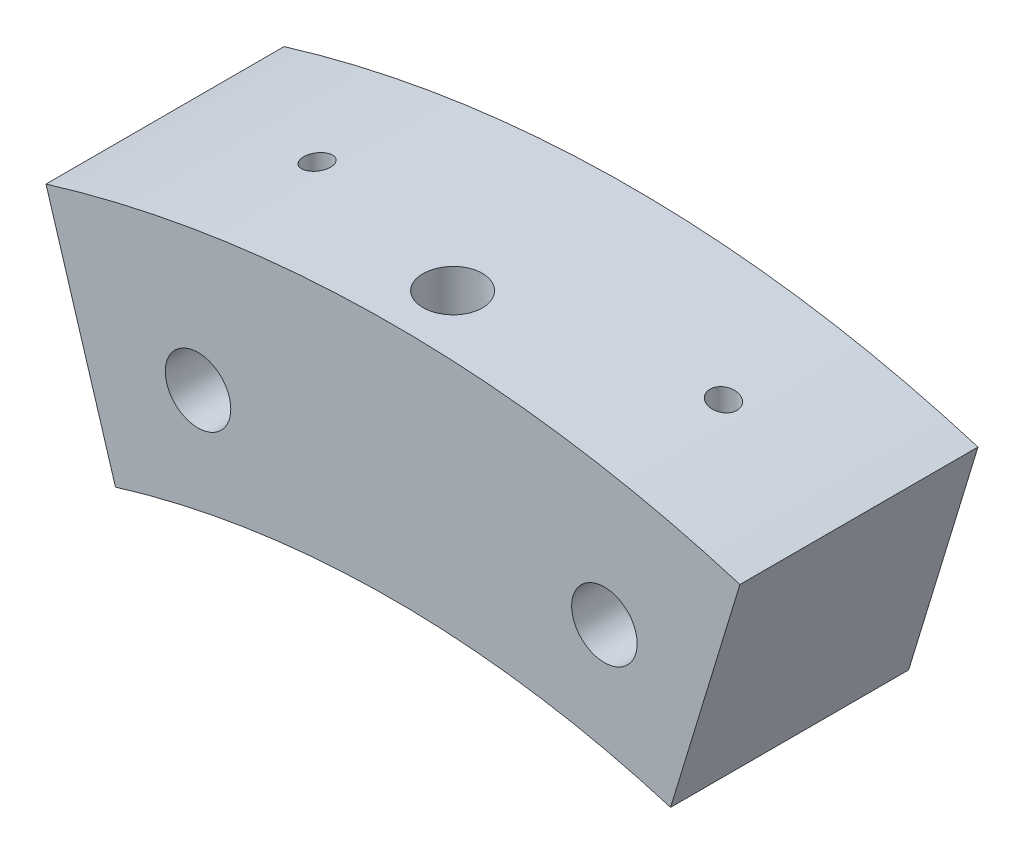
ISO-10303-21;
HEADER;
FILE_DESCRIPTION(('STEP AP214'),'2;1');
FILE_NAME('part.step','',(''),(''),'','','');
FILE_SCHEMA(('AUTOMOTIVE_DESIGN { 1 0 10303 214 1 1 1 1 }'));
ENDSEC;
DATA;
#1=APPLICATION_CONTEXT('core data for automotive mechanical design processes');
#2=APPLICATION_PROTOCOL_DEFINITION('international standard','automotive_design',2000,#1);
#3=PRODUCT_CONTEXT('',#1,'mechanical');
#4=PRODUCT('Part','Part','',(#3));
#5=PRODUCT_RELATED_PRODUCT_CATEGORY('part','',(#4));
#6=PRODUCT_DEFINITION_FORMATION('','',#4);
#7=PRODUCT_DEFINITION_CONTEXT('part definition',#1,'design');
#8=PRODUCT_DEFINITION('design','',#6,#7);
#9=PRODUCT_DEFINITION_SHAPE('','',#8);
#10=(LENGTH_UNIT() NAMED_UNIT(*) SI_UNIT(.MILLI.,.METRE.));
#11=(NAMED_UNIT(*) PLANE_ANGLE_UNIT() SI_UNIT($,.RADIAN.));
#12=(NAMED_UNIT(*) SI_UNIT($,.STERADIAN.) SOLID_ANGLE_UNIT());
#13=UNCERTAINTY_MEASURE_WITH_UNIT(LENGTH_MEASURE(1.E-05),#10,'distance_accuracy_value','');
#14=(GEOMETRIC_REPRESENTATION_CONTEXT(3) GLOBAL_UNCERTAINTY_ASSIGNED_CONTEXT((#13)) GLOBAL_UNIT_ASSIGNED_CONTEXT((#10,
#11,#12)) REPRESENTATION_CONTEXT('',''));
#15=CARTESIAN_POINT('',(0.,0.,0.));
#16=DIRECTION('',(0.,0.,1.));
#17=DIRECTION('',(1.,0.,0.));
#18=AXIS2_PLACEMENT_3D('',#15,#16,#17);
#19=CARTESIAN_POINT('',(0.,91.1044008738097,17.8816));
#20=DIRECTION('',(0.,1.,0.));
#21=DIRECTION('',(0.,0.,1.));
#22=AXIS2_PLACEMENT_3D('',#19,#20,#21);
#23=CYLINDRICAL_SURFACE('',#22,1.78435);
#24=CARTESIAN_POINT('',(0.,95.25,19.66595));
#25=CARTESIAN_POINT('',(0.100218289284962,95.2499997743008,19.6659455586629));
#26=CARTESIAN_POINT('',(0.200509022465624,95.2498401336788,19.6574785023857));
#27=CARTESIAN_POINT('',(0.398327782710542,95.2492186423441,19.6238195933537));
#28=CARTESIAN_POINT('',(0.495852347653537,95.2487564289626,19.5986076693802));
#29=CARTESIAN_POINT('',(0.685244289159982,95.2475821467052,19.5321775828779));
#30=CARTESIAN_POINT('',(0.777114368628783,95.2468701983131,19.4909671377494));
#31=CARTESIAN_POINT('',(0.952606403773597,95.2452767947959,19.3937206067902));
#32=CARTESIAN_POINT('',(1.03623038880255,95.2443953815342,19.3376881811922));
#33=CARTESIAN_POINT('',(1.19290466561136,95.242562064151,19.2123696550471));
#34=CARTESIAN_POINT('',(1.26595268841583,95.241610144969,19.1430807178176));
#35=CARTESIAN_POINT('',(1.39938273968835,95.2397432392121,18.9932199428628));
#36=CARTESIAN_POINT('',(1.45976426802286,95.2388282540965,18.9126476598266));
#37=CARTESIAN_POINT('',(1.56614706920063,95.2371383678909,18.7425037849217));
#38=CARTESIAN_POINT('',(1.6121475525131,95.2363634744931,18.6529316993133));
#39=CARTESIAN_POINT('',(1.68845710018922,95.2350412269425,18.4673344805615));
#40=CARTESIAN_POINT('',(1.7187662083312,95.234493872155,18.3713093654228));
#41=CARTESIAN_POINT('',(1.76282933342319,95.2336884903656,18.1755437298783));
#42=CARTESIAN_POINT('',(1.77658528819,95.2334304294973,18.0758036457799));
#43=CARTESIAN_POINT('',(1.78715757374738,95.2332326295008,17.8754296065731));
#44=CARTESIAN_POINT('',(1.78397394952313,95.2332928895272,17.7747956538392));
#45=CARTESIAN_POINT('',(1.7607591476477,95.2337249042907,17.5755036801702));
#46=CARTESIAN_POINT('',(1.74073008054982,95.2340966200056,17.4768454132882));
#47=CARTESIAN_POINT('',(1.68439619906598,95.2351095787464,17.2842918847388));
#48=CARTESIAN_POINT('',(1.64809136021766,95.2357508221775,17.1903966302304));
#49=CARTESIAN_POINT('',(1.56023408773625,95.2372305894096,17.0100277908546));
#50=CARTESIAN_POINT('',(1.50868068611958,95.2380691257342,16.9235546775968));
#51=CARTESIAN_POINT('',(1.39179045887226,95.2398489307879,16.7604900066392));
#52=CARTESIAN_POINT('',(1.32645362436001,95.2407901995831,16.6838984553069));
#53=CARTESIAN_POINT('',(1.18383924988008,95.2426695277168,16.5427587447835));
#54=CARTESIAN_POINT('',(1.10655987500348,95.2436075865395,16.4782124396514));
#55=CARTESIAN_POINT('',(0.942260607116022,95.245374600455,16.3630097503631));
#56=CARTESIAN_POINT('',(0.855240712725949,95.2462035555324,16.3123533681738));
#57=CARTESIAN_POINT('',(0.673929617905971,95.2476589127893,16.2263687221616));
#58=CARTESIAN_POINT('',(0.579638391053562,95.2482853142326,16.1910405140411));
#59=CARTESIAN_POINT('',(0.386461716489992,95.2492649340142,16.136716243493));
#60=CARTESIAN_POINT('',(0.287576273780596,95.2496181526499,16.1177201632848));
#61=CARTESIAN_POINT('',(0.0880343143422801,95.250011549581,16.0966016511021));
#62=CARTESIAN_POINT('',(-0.0126219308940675,95.2500517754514,16.0944766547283));
#63=CARTESIAN_POINT('',(-0.212862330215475,95.2498147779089,16.1071539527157));
#64=CARTESIAN_POINT('',(-0.31244648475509,95.2495375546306,16.1219562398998));
#65=CARTESIAN_POINT('',(-0.507708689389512,95.2486969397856,16.1680657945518));
#66=CARTESIAN_POINT('',(-0.603387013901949,95.2481335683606,16.1993719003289));
#67=CARTESIAN_POINT('',(-0.788129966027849,95.2467841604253,16.2775992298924));
#68=CARTESIAN_POINT('',(-0.877194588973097,95.2459981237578,16.3245204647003));
#69=CARTESIAN_POINT('',(-1.04619369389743,95.2442918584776,16.4326527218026));
#70=CARTESIAN_POINT('',(-1.12612707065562,95.2433716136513,16.493865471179));
#71=CARTESIAN_POINT('',(-1.27458355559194,95.2415007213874,16.6288406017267));
#72=CARTESIAN_POINT('',(-1.34310664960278,95.240550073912,16.7026029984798));
#73=CARTESIAN_POINT('',(-1.46680594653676,95.2387254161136,16.8605945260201));
#74=CARTESIAN_POINT('',(-1.52198049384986,95.2378514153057,16.9448249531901));
#75=CARTESIAN_POINT('',(-1.61740512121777,95.2362787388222,17.1213548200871));
#76=CARTESIAN_POINT('',(-1.65765522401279,95.2355800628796,17.2136542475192));
#77=CARTESIAN_POINT('',(-1.72208553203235,95.2344368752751,17.4036958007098));
#78=CARTESIAN_POINT('',(-1.74626681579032,95.2339923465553,17.5014375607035));
#79=CARTESIAN_POINT('',(-1.77787661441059,95.2334075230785,17.6995945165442));
#80=CARTESIAN_POINT('',(-1.78530511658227,95.233267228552,17.8000097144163));
#81=CARTESIAN_POINT('',(-1.783198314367,95.2333066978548,18.000646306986));
#82=CARTESIAN_POINT('',(-1.77366563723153,95.2334864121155,18.1008677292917));
#83=CARTESIAN_POINT('',(-1.73791244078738,95.2341455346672,18.2982875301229));
#84=CARTESIAN_POINT('',(-1.71169188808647,95.2346249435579,18.395485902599));
#85=CARTESIAN_POINT('',(-1.64330723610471,95.2358294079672,18.5841024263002));
#86=CARTESIAN_POINT('',(-1.60114284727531,95.2365544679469,18.6755204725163));
#87=CARTESIAN_POINT('',(-1.50206942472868,95.2381684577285,18.8499772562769));
#88=CARTESIAN_POINT('',(-1.44516095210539,95.2390573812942,18.9330163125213));
#89=CARTESIAN_POINT('',(-1.31821126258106,95.2408989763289,19.0883674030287));
#90=CARTESIAN_POINT('',(-1.24816940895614,95.2418516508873,19.1606789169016));
#91=CARTESIAN_POINT('',(-1.09691946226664,95.2437135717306,19.2925355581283));
#92=CARTESIAN_POINT('',(-1.01570860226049,95.2446228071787,19.3520775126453));
#93=CARTESIAN_POINT('',(-0.844404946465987,95.2462955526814,19.4567090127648));
#94=CARTESIAN_POINT('',(-0.754307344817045,95.2470589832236,19.5017906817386));
#95=CARTESIAN_POINT('',(-0.567891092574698,95.2483524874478,19.5761357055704));
#96=CARTESIAN_POINT('',(-0.471580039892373,95.2488828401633,19.6054179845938));
#97=CARTESIAN_POINT('',(-0.312214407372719,95.2495081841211,19.6395458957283));
#98=CARTESIAN_POINT('',(-0.250194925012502,95.2496918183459,19.6494350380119));
#99=CARTESIAN_POINT('',(-0.125459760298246,95.2499377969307,19.6626384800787));
#100=CARTESIAN_POINT('',(-0.0627440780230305,95.2500001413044,19.6659527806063));
#101=CARTESIAN_POINT('',(0.,95.25,19.66595));
#102=B_SPLINE_CURVE_WITH_KNOTS('',3,(#24,#25,#26,#27,#28,#29,#30,#31,#32,#33,#34,#35,#36,#37,
#38,#39,#40,#41,#42,#43,#44,#45,#46,#47,#48,#49,#50,#51,#52,#53,#54,#55,#56,#57,#58,#59,#60,#61,
#62,#63,#64,#65,#66,#67,#68,#69,#70,#71,#72,#73,#74,#75,#76,#77,#78,#79,#80,#81,#82,#83,#84,#85,
#86,#87,#88,#89,#90,#91,#92,#93,#94,#95,#96,#97,#98,#99,#100,#101),.UNSPECIFIED.,.T.,.F.,(4,2,2,
2,2,2,2,2,2,2,2,2,2,2,2,2,2,2,2,2,2,2,2,2,2,2,2,2,2,2,2,2,2,2,2,2,2,2,4),(0.,0.300425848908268,
0.601212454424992,0.901854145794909,1.20242166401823,1.50305357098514,1.80369734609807,
2.10435762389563,2.40501706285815,2.70564130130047,3.0062647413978,3.3068505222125,
3.60743675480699,3.90804207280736,4.20864758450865,4.50929932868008,4.80995111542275,
5.11060399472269,5.41125654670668,5.7118633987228,6.01247012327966,6.31305569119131,
6.61364147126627,6.91426359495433,7.21488609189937,7.51554585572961,7.81620516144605,
8.11684428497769,8.41748363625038,8.71807642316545,9.0186698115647,9.31926865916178,
9.61985606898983,9.92045805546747,10.221134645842,10.5219747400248,10.8224536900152,
11.010542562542,11.198631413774),.UNSPECIFIED.);
#103=CARTESIAN_POINT('',(0.,95.25,19.66595));
#104=VERTEX_POINT('',#103);
#105=EDGE_CURVE('E136',#104,#104,#102,.T.);
#106=ORIENTED_EDGE('',*,*,#105,.F.);
#107=EDGE_LOOP('',(#106));
#108=FACE_BOUND('',#107,.T.);
#109=CARTESIAN_POINT('',(0.,113.6142,17.8816));
#110=DIRECTION('',(0.,1.,0.));
#111=DIRECTION('',(0.,0.,1.));
#112=AXIS2_PLACEMENT_3D('',#109,#110,#111);
#113=CIRCLE('',#112,1.78435);
#114=CARTESIAN_POINT('',(0.,113.6142,19.66595));
#115=VERTEX_POINT('',#114);
#116=EDGE_CURVE('E234',#115,#115,#113,.F.);
#117=ORIENTED_EDGE('',*,*,#116,.F.);
#118=EDGE_LOOP('',(#117));
#119=FACE_BOUND('',#118,.T.);
#120=ADVANCED_FACE('F39',(#108,#119),#23,.F.);
#121=CARTESIAN_POINT('',(0.,0.,23.8252));
#122=DIRECTION('',(0.,0.,-1.));
#123=DIRECTION('',(-1.,0.,0.));
#124=AXIS2_PLACEMENT_3D('',#121,#122,#123);
#125=CYLINDRICAL_SURFACE('',#124,95.25);
#126=ORIENTED_EDGE('',*,*,#105,.T.);
#127=EDGE_LOOP('',(#126));
#128=FACE_BOUND('',#127,.T.);
#129=CARTESIAN_POINT('',(0.,0.,0.));
#130=DIRECTION('',(0.,0.,-1.));
#131=DIRECTION('',(1.,0.,0.));
#132=AXIS2_PLACEMENT_3D('',#129,#130,#131);
#133=CIRCLE('',#132,95.25);
#134=CARTESIAN_POINT('',(-27.794795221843,91.1044008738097,0.));
#135=VERTEX_POINT('',#134);
#136=CARTESIAN_POINT('',(27.754159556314,91.1167883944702,0.));
#137=VERTEX_POINT('',#136);
#138=EDGE_CURVE('E142',#135,#137,#133,.T.);
#139=ORIENTED_EDGE('',*,*,#138,.T.);
#140=DIRECTION('',(0.,0.,-1.));
#141=VECTOR('',#140,1.);
#142=CARTESIAN_POINT('',(27.754159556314,91.1167883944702,23.8252));
#143=LINE('',#142,#141);
#144=CARTESIAN_POINT('',(27.754159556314,91.1167883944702,23.8252));
#145=VERTEX_POINT('',#144);
#146=EDGE_CURVE('E53',#145,#137,#143,.T.);
#147=ORIENTED_EDGE('',*,*,#146,.F.);
#148=CARTESIAN_POINT('',(0.,0.,23.8252));
#149=DIRECTION('',(0.,0.,-1.));
#150=DIRECTION('',(1.,0.,0.));
#151=AXIS2_PLACEMENT_3D('',#148,#149,#150);
#152=CIRCLE('',#151,95.25);
#153=CARTESIAN_POINT('',(-27.794795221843,91.1044008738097,23.8252));
#154=VERTEX_POINT('',#153);
#155=EDGE_CURVE('E148',#154,#145,#152,.T.);
#156=ORIENTED_EDGE('',*,*,#155,.F.);
#157=DIRECTION('',(0.,0.,-1.));
#158=VECTOR('',#157,1.);
#159=CARTESIAN_POINT('',(-27.794795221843,91.1044008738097,23.8252));
#160=LINE('',#159,#158);
#161=EDGE_CURVE('E154',#154,#135,#160,.T.);
#162=ORIENTED_EDGE('',*,*,#161,.T.);
#163=EDGE_LOOP('',(#139,#147,#156,#162));
#164=FACE_BOUND('',#163,.T.);
#165=ADVANCED_FACE('F41',(#128,#164),#125,.F.);
#166=CARTESIAN_POINT('',(27.754159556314,91.1167883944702,23.8252));
#167=DIRECTION('',(-0.956606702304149,0.291382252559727,0.));
#168=DIRECTION('',(-0.291382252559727,-0.956606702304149,0.));
#169=AXIS2_PLACEMENT_3D('',#166,#167,#168);
#170=PLANE('',#169);
#171=DIRECTION('',(0.291382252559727,0.956606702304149,0.));
#172=VECTOR('',#171,1.);
#173=CARTESIAN_POINT('',(27.754159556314,91.1167883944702,0.));
#174=LINE('',#173,#172);
#175=CARTESIAN_POINT('',(34.6964,113.908134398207,0.));
#176=VERTEX_POINT('',#175);
#177=EDGE_CURVE('E157',#137,#176,#174,.T.);
#178=ORIENTED_EDGE('',*,*,#177,.T.);
#179=DIRECTION('',(0.,0.,-1.));
#180=VECTOR('',#179,1.);
#181=CARTESIAN_POINT('',(34.6964,113.908134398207,23.8252));
#182=LINE('',#181,#180);
#183=CARTESIAN_POINT('',(34.6964,113.908134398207,23.8252));
#184=VERTEX_POINT('',#183);
#185=EDGE_CURVE('E164',#184,#176,#182,.T.);
#186=ORIENTED_EDGE('',*,*,#185,.F.);
#187=DIRECTION('',(0.291382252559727,0.956606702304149,0.));
#188=VECTOR('',#187,1.);
#189=CARTESIAN_POINT('',(27.754159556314,91.1167883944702,23.8252));
#190=LINE('',#189,#188);
#191=EDGE_CURVE('E93',#145,#184,#190,.T.);
#192=ORIENTED_EDGE('',*,*,#191,.F.);
#193=ORIENTED_EDGE('',*,*,#146,.T.);
#194=EDGE_LOOP('',(#178,#186,#192,#193));
#195=FACE_BOUND('',#194,.T.);
#196=ADVANCED_FACE('F126',(#195),#170,.F.);
#197=CARTESIAN_POINT('',(0.,0.,23.8252));
#198=DIRECTION('',(0.,0.,-1.));
#199=DIRECTION('',(-1.,0.,0.));
#200=AXIS2_PLACEMENT_3D('',#197,#198,#199);
#201=CYLINDRICAL_SURFACE('',#200,119.0752);
#202=CARTESIAN_POINT('',(-19.5326,117.462252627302,13.26515));
#203=CARTESIAN_POINT('',(-19.6094459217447,117.44947393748,13.2651467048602));
#204=CARTESIAN_POINT('',(-19.6863352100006,117.436609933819,13.2585803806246));
#205=CARTESIAN_POINT('',(-19.8379839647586,117.411087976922,13.2324732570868));
#206=CARTESIAN_POINT('',(-19.9127406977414,117.398430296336,13.2129165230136));
#207=CARTESIAN_POINT('',(-20.057920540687,117.373712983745,13.1613432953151));
#208=CARTESIAN_POINT('',(-20.1283446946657,117.361653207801,13.1293298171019));
#209=CARTESIAN_POINT('',(-20.2628178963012,117.338510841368,13.0537058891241));
#210=CARTESIAN_POINT('',(-20.3268687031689,117.327427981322,13.0100986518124));
#211=CARTESIAN_POINT('',(-20.4463985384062,117.306656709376,12.9127363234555));
#212=CARTESIAN_POINT('',(-20.5019223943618,117.29696102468,12.8590378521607));
#213=CARTESIAN_POINT('',(-20.6031421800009,117.279224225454,12.742821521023));
#214=CARTESIAN_POINT('',(-20.6488383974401,117.271183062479,12.6803039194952));
#215=CARTESIAN_POINT('',(-20.7284304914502,117.257140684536,12.5491412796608));
#216=CARTESIAN_POINT('',(-20.762479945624,117.25111294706,12.480592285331));
#217=CARTESIAN_POINT('',(-20.8185768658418,117.241165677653,12.3386049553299));
#218=CARTESIAN_POINT('',(-20.8406254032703,117.237245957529,12.2651670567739));
#219=CARTESIAN_POINT('',(-20.8718031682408,117.231699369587,12.1165830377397));
#220=CARTESIAN_POINT('',(-20.8811075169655,117.23004142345,12.0414747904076));
#221=CARTESIAN_POINT('',(-20.8870747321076,117.228978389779,11.8907437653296));
#222=CARTESIAN_POINT('',(-20.8837382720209,117.229573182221,11.8151210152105));
#223=CARTESIAN_POINT('',(-20.8645966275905,117.232981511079,11.6660537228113));
#224=CARTESIAN_POINT('',(-20.8488772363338,117.235779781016,11.5925977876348));
#225=CARTESIAN_POINT('',(-20.8055603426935,117.243474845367,11.4493942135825));
#226=CARTESIAN_POINT('',(-20.7779627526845,117.248371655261,11.3796466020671));
#227=CARTESIAN_POINT('',(-20.7116013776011,117.260112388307,11.2455431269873));
#228=CARTESIAN_POINT('',(-20.672796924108,117.266963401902,11.1812080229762));
#229=CARTESIAN_POINT('',(-20.5852133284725,117.282369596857,11.0599625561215));
#230=CARTESIAN_POINT('',(-20.5364336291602,117.290924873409,11.0030526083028));
#231=CARTESIAN_POINT('',(-20.4296558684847,117.309570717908,10.8975212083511));
#232=CARTESIAN_POINT('',(-20.3715528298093,117.319678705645,10.849009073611));
#233=CARTESIAN_POINT('',(-20.2482265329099,117.341026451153,10.7624047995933));
#234=CARTESIAN_POINT('',(-20.1830027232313,117.352266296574,10.7243134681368));
#235=CARTESIAN_POINT('',(-20.0462639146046,117.375702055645,10.6590601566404));
#236=CARTESIAN_POINT('',(-19.9746713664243,117.387909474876,10.6320647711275));
#237=CARTESIAN_POINT('',(-19.8280359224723,117.412766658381,10.5905117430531));
#238=CARTESIAN_POINT('',(-19.7529928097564,117.425416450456,10.5759548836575));
#239=CARTESIAN_POINT('',(-19.6007784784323,117.450920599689,10.5595809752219));
#240=CARTESIAN_POINT('',(-19.5235934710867,117.463775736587,10.5578930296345));
#241=CARTESIAN_POINT('',(-19.3700090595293,117.489199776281,10.5676550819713));
#242=CARTESIAN_POINT('',(-19.2936096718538,117.501768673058,10.5791053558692));
#243=CARTESIAN_POINT('',(-19.1436665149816,117.52629096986,10.6148824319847));
#244=CARTESIAN_POINT('',(-19.0701268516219,117.53824349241,10.6392270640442));
#245=CARTESIAN_POINT('',(-18.9281478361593,117.561191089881,10.70016594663));
#246=CARTESIAN_POINT('',(-18.8597083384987,117.572186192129,10.7367598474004));
#247=CARTESIAN_POINT('',(-18.7304130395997,117.592853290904,10.8209063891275));
#248=CARTESIAN_POINT('',(-18.6695069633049,117.60253410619,10.868379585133));
#249=CARTESIAN_POINT('',(-18.5565371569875,117.620412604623,10.9731189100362));
#250=CARTESIAN_POINT('',(-18.5044728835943,117.628610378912,11.0303844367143));
#251=CARTESIAN_POINT('',(-18.4113291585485,117.643225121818,11.1523615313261));
#252=CARTESIAN_POINT('',(-18.3701274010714,117.649661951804,11.2169773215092));
#253=CARTESIAN_POINT('',(-18.2991668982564,117.660720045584,11.3523556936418));
#254=CARTESIAN_POINT('',(-18.2694073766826,117.665341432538,11.4231178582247));
#255=CARTESIAN_POINT('',(-18.2225209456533,117.672611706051,11.5679121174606));
#256=CARTESIAN_POINT('',(-18.2052540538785,117.675282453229,11.6418978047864));
#257=CARTESIAN_POINT('',(-18.1833326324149,117.678671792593,11.7917575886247));
#258=CARTESIAN_POINT('',(-18.1786775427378,117.679390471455,11.867631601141));
#259=CARTESIAN_POINT('',(-18.1821103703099,117.678860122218,12.0185727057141));
#260=CARTESIAN_POINT('',(-18.1901131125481,117.677624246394,12.093641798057));
#261=CARTESIAN_POINT('',(-18.218458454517,117.673239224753,12.2413536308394));
#262=CARTESIAN_POINT('',(-18.2388009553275,117.670090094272,12.3139963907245));
#263=CARTESIAN_POINT('',(-18.2912175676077,117.661953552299,12.4548247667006));
#264=CARTESIAN_POINT('',(-18.3232943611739,117.656965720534,12.5230093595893));
#265=CARTESIAN_POINT('',(-18.3982213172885,117.645272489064,12.6530088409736));
#266=CARTESIAN_POINT('',(-18.4410713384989,117.638567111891,12.7148238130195));
#267=CARTESIAN_POINT('',(-18.5366188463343,117.623549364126,12.8308031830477));
#268=CARTESIAN_POINT('',(-18.5893819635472,117.615226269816,12.8849121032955));
#269=CARTESIAN_POINT('',(-18.7030442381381,117.597205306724,12.9835301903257));
#270=CARTESIAN_POINT('',(-18.7639458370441,117.587507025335,13.0280364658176));
#271=CARTESIAN_POINT('',(-18.8928984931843,117.566857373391,13.1067308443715));
#272=CARTESIAN_POINT('',(-18.9610257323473,117.55589251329,13.1407904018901));
#273=CARTESIAN_POINT('',(-19.1018389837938,117.533093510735,13.1969561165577));
#274=CARTESIAN_POINT('',(-19.1745198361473,117.521260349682,13.2190755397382));
#275=CARTESIAN_POINT('',(-19.2951301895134,117.501504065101,13.2449984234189));
#276=CARTESIAN_POINT('',(-19.3423152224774,117.493746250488,13.2525473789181));
#277=CARTESIAN_POINT('',(-19.4371945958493,117.478087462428,13.2626242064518));
#278=CARTESIAN_POINT('',(-19.4848889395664,117.470186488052,13.265152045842));
#279=CARTESIAN_POINT('',(-19.5326,117.462252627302,13.26515));
#280=B_SPLINE_CURVE_WITH_KNOTS('',3,(#202,#203,#204,#205,#206,#207,#208,#209,#210,#211,#212,
#213,#214,#215,#216,#217,#218,#219,#220,#221,#222,#223,#224,#225,#226,#227,#228,#229,#230,#231,
#232,#233,#234,#235,#236,#237,#238,#239,#240,#241,#242,#243,#244,#245,#246,#247,#248,#249,#250,
#251,#252,#253,#254,#255,#256,#257,#258,#259,#260,#261,#262,#263,#264,#265,#266,#267,#268,#269,
#270,#271,#272,#273,#274,#275,#276,#277,#278,#279),.UNSPECIFIED.,.T.,.F.,(4,2,2,2,2,2,2,2,2,2,2,
2,2,2,2,2,2,2,2,2,2,2,2,2,2,2,2,2,2,2,2,2,2,2,2,2,2,2,4),(0.,0.233527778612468,0.46734254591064,
0.7011007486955,0.934794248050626,1.16721370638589,1.39962635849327,1.62884416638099,
1.85804150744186,2.08405667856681,2.31005980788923,2.53451073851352,2.75896332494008,
2.98424088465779,3.20953103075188,3.43756336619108,3.66561337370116,3.89697219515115,
4.12834558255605,4.36203713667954,4.5957335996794,4.82975405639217,5.06376783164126,
5.29612432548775,5.52846653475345,5.75806866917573,5.98765522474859,6.21462760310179,
6.4415899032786,6.66703145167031,6.89247119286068,7.11796249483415,7.34345083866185,
7.57048830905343,7.79759404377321,8.02739149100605,8.2569330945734,8.40192173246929,
8.54691131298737),.UNSPECIFIED.);
#281=CARTESIAN_POINT('',(-19.5326,117.462252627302,13.26515));
#282=VERTEX_POINT('',#281);
#283=EDGE_CURVE('E171',#282,#282,#280,.T.);
#284=ORIENTED_EDGE('',*,*,#283,.T.);
#285=EDGE_LOOP('',(#284));
#286=FACE_BOUND('',#285,.T.);
#287=CARTESIAN_POINT('',(21.1328,117.184930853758,13.26515));
#288=CARTESIAN_POINT('',(21.0560076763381,117.198779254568,13.2651467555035));
#289=CARTESIAN_POINT('',(20.97914675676,117.212561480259,13.2585899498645));
#290=CARTESIAN_POINT('',(20.8274978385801,117.239603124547,13.2324918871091));
#291=CARTESIAN_POINT('',(20.7527124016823,117.252861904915,13.2129352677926));
#292=CARTESIAN_POINT('',(20.6074186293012,117.278484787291,13.161321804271));
#293=CARTESIAN_POINT('',(20.5369099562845,117.290848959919,13.1292659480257));
#294=CARTESIAN_POINT('',(20.4022535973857,117.31434686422,13.0535032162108));
#295=CARTESIAN_POINT('',(20.3381041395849,117.325480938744,13.0097995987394));
#296=CARTESIAN_POINT('',(20.2185502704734,117.346142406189,12.9123198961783));
#297=CARTESIAN_POINT('',(20.1630799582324,117.355681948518,12.8586272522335));
#298=CARTESIAN_POINT('',(20.0619573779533,117.373011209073,12.7424302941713));
#299=CARTESIAN_POINT('',(20.0163047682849,117.380800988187,12.6799262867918));
#300=CARTESIAN_POINT('',(19.9368203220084,117.394327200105,12.5488502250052));
#301=CARTESIAN_POINT('',(19.9028275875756,117.400091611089,12.4803786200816));
#302=CARTESIAN_POINT('',(19.8468169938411,117.409573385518,12.3385690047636));
#303=CARTESIAN_POINT('',(19.8247981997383,117.413290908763,12.2652313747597));
#304=CARTESIAN_POINT('',(19.7936191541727,117.418551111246,12.1167368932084));
#305=CARTESIAN_POINT('',(19.7843048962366,117.420119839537,12.0416132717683));
#306=CARTESIAN_POINT('',(19.7783226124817,117.421127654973,11.8908514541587));
#307=CARTESIAN_POINT('',(19.7816540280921,117.420566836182,11.8152132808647));
#308=CARTESIAN_POINT('',(19.8008047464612,117.417338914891,11.6660109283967));
#309=CARTESIAN_POINT('',(19.8165546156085,117.414683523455,11.5924375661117));
#310=CARTESIAN_POINT('',(19.8599740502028,117.407347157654,11.4490050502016));
#311=CARTESIAN_POINT('',(19.887643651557,117.402666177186,11.3791459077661));
#312=CARTESIAN_POINT('',(19.9541651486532,117.391378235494,11.2448870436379));
#313=CARTESIAN_POINT('',(19.9930496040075,117.384765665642,11.1805039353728));
#314=CARTESIAN_POINT('',(20.0808105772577,117.36978434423,11.0591858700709));
#315=CARTESIAN_POINT('',(20.1296875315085,117.361415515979,11.002251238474));
#316=CARTESIAN_POINT('',(20.2365645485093,117.343034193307,10.8968012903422));
#317=CARTESIAN_POINT('',(20.29465373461,117.333005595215,10.8483791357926));
#318=CARTESIAN_POINT('',(20.4179060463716,117.311620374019,10.7619547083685));
#319=CARTESIAN_POINT('',(20.4830696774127,117.300263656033,10.7239531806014));
#320=CARTESIAN_POINT('',(20.619600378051,117.276341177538,10.6588788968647));
#321=CARTESIAN_POINT('',(20.6910421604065,117.263760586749,10.6319683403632));
#322=CARTESIAN_POINT('',(20.8373040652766,117.23785876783,10.5905363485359));
#323=CARTESIAN_POINT('',(20.9121244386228,117.224537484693,10.5760158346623));
#324=CARTESIAN_POINT('',(21.0640250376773,117.197338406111,10.5596144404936));
#325=CARTESIAN_POINT('',(21.141121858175,117.183455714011,10.5578950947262));
#326=CARTESIAN_POINT('',(21.2944915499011,117.155682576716,10.5675527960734));
#327=CARTESIAN_POINT('',(21.3707643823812,117.14179213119,10.5789304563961));
#328=CARTESIAN_POINT('',(21.5207536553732,117.114329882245,10.6145794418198));
#329=CARTESIAN_POINT('',(21.5944538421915,117.100760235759,10.6389209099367));
#330=CARTESIAN_POINT('',(21.7367382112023,117.07443233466,10.6999002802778));
#331=CARTESIAN_POINT('',(21.8053224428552,117.061674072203,10.7365380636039));
#332=CARTESIAN_POINT('',(21.9350317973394,117.03743833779,10.8209172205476));
#333=CARTESIAN_POINT('',(21.9961929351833,117.025954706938,10.8686014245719));
#334=CARTESIAN_POINT('',(22.1096217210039,117.004577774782,10.97387922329));
#335=CARTESIAN_POINT('',(22.161890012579,116.994684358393,11.0314721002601));
#336=CARTESIAN_POINT('',(22.255237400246,116.976963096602,11.1540642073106));
#337=CARTESIAN_POINT('',(22.2964659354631,116.969107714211,11.2189456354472));
#338=CARTESIAN_POINT('',(22.3674150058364,116.955561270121,11.3549292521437));
#339=CARTESIAN_POINT('',(22.3971367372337,116.949869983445,11.4260307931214));
#340=CARTESIAN_POINT('',(22.443714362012,116.940940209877,11.5711296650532));
#341=CARTESIAN_POINT('',(22.460781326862,116.937661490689,11.6450567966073));
#342=CARTESIAN_POINT('',(22.482330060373,116.933520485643,11.7947878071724));
#343=CARTESIAN_POINT('',(22.4868127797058,116.93265801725,11.8705915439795));
#344=CARTESIAN_POINT('',(22.4830720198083,116.933377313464,12.0210195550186));
#345=CARTESIAN_POINT('',(22.4749902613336,116.93493181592,12.0956475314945));
#346=CARTESIAN_POINT('',(22.4466389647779,116.940377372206,12.2424606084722));
#347=CARTESIAN_POINT('',(22.4263695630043,116.944268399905,12.3146457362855));
#348=CARTESIAN_POINT('',(22.3742603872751,116.954249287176,12.4545824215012));
#349=CARTESIAN_POINT('',(22.3424153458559,116.960340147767,12.5223319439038));
#350=CARTESIAN_POINT('',(22.2681226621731,116.97450744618,12.6515087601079));
#351=CARTESIAN_POINT('',(22.2256749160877,116.982583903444,12.712935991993));
#352=CARTESIAN_POINT('',(22.1308761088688,117.000555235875,12.8285071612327));
#353=CARTESIAN_POINT('',(22.0784162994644,117.0104700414,12.882558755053));
#354=CARTESIAN_POINT('',(21.9654243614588,117.031733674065,12.9811274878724));
#355=CARTESIAN_POINT('',(21.9048895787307,117.043082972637,13.0256414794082));
#356=CARTESIAN_POINT('',(21.7763520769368,117.067066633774,13.1046672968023));
#357=CARTESIAN_POINT('',(21.7082377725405,117.079719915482,13.1389916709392));
#358=CARTESIAN_POINT('',(21.5673932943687,117.105746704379,13.1956710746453));
#359=CARTESIAN_POINT('',(21.4946682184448,117.119119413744,13.2180390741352));
#360=CARTESIAN_POINT('',(21.3734010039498,117.14129633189,13.2444587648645));
#361=CARTESIAN_POINT('',(21.3256148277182,117.150005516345,13.2522082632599));
#362=CARTESIAN_POINT('',(21.2294948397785,117.167462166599,13.2625549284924));
#363=CARTESIAN_POINT('',(21.1811610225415,117.176209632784,13.2651520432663));
#364=CARTESIAN_POINT('',(21.1328,117.184930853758,13.26515));
#365=B_SPLINE_CURVE_WITH_KNOTS('',3,(#287,#288,#289,#290,#291,#292,#293,#294,#295,#296,#297,
#298,#299,#300,#301,#302,#303,#304,#305,#306,#307,#308,#309,#310,#311,#312,#313,#314,#315,#316,
#317,#318,#319,#320,#321,#322,#323,#324,#325,#326,#327,#328,#329,#330,#331,#332,#333,#334,#335,
#336,#337,#338,#339,#340,#341,#342,#343,#344,#345,#346,#347,#348,#349,#350,#351,#352,#353,#354,
#355,#356,#357,#358,#359,#360,#361,#362,#363,#364),.UNSPECIFIED.,.T.,.F.,(4,2,2,2,2,2,2,2,2,2,2,
2,2,2,2,2,2,2,2,2,2,2,2,2,2,2,2,2,2,2,2,2,2,2,2,2,2,2,4),(0.,0.233915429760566,
0.468107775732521,0.702281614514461,0.93639001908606,1.1686241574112,1.40085021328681,
1.629729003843,1.85858992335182,2.08465113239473,2.31070235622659,2.53549857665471,
2.76029547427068,2.98575170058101,3.21121777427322,3.4390156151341,3.6668297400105,
3.89786645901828,4.12892035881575,4.36288500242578,4.59686060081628,4.83211522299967,
5.06736757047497,5.30142856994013,5.53547262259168,5.76616690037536,5.9968371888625,
6.22356775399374,6.45028119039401,6.67445591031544,6.89862812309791,7.12290247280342,
7.34717901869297,7.57404665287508,7.80098903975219,8.03187898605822,8.26251795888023,
8.40982793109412,8.5571393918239),.UNSPECIFIED.);
#366=CARTESIAN_POINT('',(21.1328,117.184930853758,13.26515));
#367=VERTEX_POINT('',#366);
#368=EDGE_CURVE('E143',#367,#367,#365,.T.);
#369=ORIENTED_EDGE('',*,*,#368,.T.);
#370=EDGE_LOOP('',(#369));
#371=FACE_BOUND('',#370,.T.);
#372=CARTESIAN_POINT('',(0.,119.0752,20.8534));
#373=CARTESIAN_POINT('',(-0.166899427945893,119.075199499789,20.8533926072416));
#374=CARTESIAN_POINT('',(-0.333919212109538,119.074845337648,20.8392929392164));
#375=CARTESIAN_POINT('',(-0.66335705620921,119.073466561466,20.7832432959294));
#376=CARTESIAN_POINT('',(-0.825769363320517,119.0724411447,20.7412599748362));
#377=CARTESIAN_POINT('',(-1.14117197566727,119.069835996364,20.6306406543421));
#378=CARTESIAN_POINT('',(-1.29416681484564,119.068256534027,20.5620175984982));
#379=CARTESIAN_POINT('',(-1.58642197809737,119.064721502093,20.4000850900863));
#380=CARTESIAN_POINT('',(-1.72568566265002,119.062766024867,20.3067816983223));
#381=CARTESIAN_POINT('',(-1.9866185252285,119.058698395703,20.0980967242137));
#382=CARTESIAN_POINT('',(-2.10828242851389,119.056586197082,19.9827085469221));
#383=CARTESIAN_POINT('',(-2.33051806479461,119.052443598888,19.7331400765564));
#384=CARTESIAN_POINT('',(-2.43108896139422,119.050413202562,19.5989590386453));
#385=CARTESIAN_POINT('',(-2.60828877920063,119.046662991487,19.3155982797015));
#386=CARTESIAN_POINT('',(-2.68491501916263,119.044943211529,19.1664168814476));
#387=CARTESIAN_POINT('',(-2.81203273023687,119.042008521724,18.8573021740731));
#388=CARTESIAN_POINT('',(-2.86252429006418,119.040793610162,18.6973689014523));
#389=CARTESIAN_POINT('',(-2.93592936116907,119.039005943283,18.3713257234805));
#390=CARTESIAN_POINT('',(-2.95884864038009,119.03843305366,18.2052171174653));
#391=CARTESIAN_POINT('',(-2.97647630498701,119.037993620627,17.8715092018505));
#392=CARTESIAN_POINT('',(-2.97118478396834,119.038127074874,17.703909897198));
#393=CARTESIAN_POINT('',(-2.93254598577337,119.039085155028,17.3720172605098));
#394=CARTESIAN_POINT('',(-2.89920495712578,119.039909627,17.2077232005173));
#395=CARTESIAN_POINT('',(-2.80542322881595,119.042156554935,16.8870649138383));
#396=CARTESIAN_POINT('',(-2.74498247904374,119.043579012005,16.7307007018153));
#397=CARTESIAN_POINT('',(-2.5987098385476,119.046861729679,16.4303207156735));
#398=CARTESIAN_POINT('',(-2.51287508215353,119.048722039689,16.2863063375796));
#399=CARTESIAN_POINT('',(-2.31825312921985,119.052670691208,16.0147294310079));
#400=CARTESIAN_POINT('',(-2.20946589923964,119.054759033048,15.8871669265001));
#401=CARTESIAN_POINT('',(-1.97199170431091,119.058929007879,15.6520783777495));
#402=CARTESIAN_POINT('',(-1.8432993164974,119.061010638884,15.5445578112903));
#403=CARTESIAN_POINT('',(-1.56968708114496,119.064931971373,15.3526474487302));
#404=CARTESIAN_POINT('',(-1.42476723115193,119.066771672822,15.2682576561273));
#405=CARTESIAN_POINT('',(-1.12281084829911,119.070001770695,15.1250050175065));
#406=CARTESIAN_POINT('',(-0.965774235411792,119.071392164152,15.0661423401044));
#407=CARTESIAN_POINT('',(-0.644043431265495,119.07356685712,14.9756183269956));
#408=CARTESIAN_POINT('',(-0.479349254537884,119.07435115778,14.9439569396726));
#409=CARTESIAN_POINT('',(-0.147026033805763,119.075225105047,14.9087409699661));
#410=CARTESIAN_POINT('',(0.0206022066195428,119.075314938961,14.9051788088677));
#411=CARTESIAN_POINT('',(0.354076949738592,119.074790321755,14.9262426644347));
#412=CARTESIAN_POINT('',(0.519923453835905,119.074175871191,14.9508686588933));
#413=CARTESIAN_POINT('',(0.845105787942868,119.072312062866,15.0276035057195));
#414=CARTESIAN_POINT('',(1.00444242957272,119.071062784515,15.0797089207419));
#415=CARTESIAN_POINT('',(1.31210690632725,119.068070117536,15.2099200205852));
#416=CARTESIAN_POINT('',(1.46043472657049,119.06632672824,15.2880257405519));
#417=CARTESIAN_POINT('',(1.74190593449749,119.06254181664,15.468039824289));
#418=CARTESIAN_POINT('',(1.87504605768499,119.060500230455,15.569953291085));
#419=CARTESIAN_POINT('',(2.12232971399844,119.056349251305,15.79468240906));
#420=CARTESIAN_POINT('',(2.23647321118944,119.054239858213,15.9174980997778));
#421=CARTESIAN_POINT('',(2.44254873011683,119.05019053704,16.1805778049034));
#422=CARTESIAN_POINT('',(2.53447586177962,119.048250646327,16.3208456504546));
#423=CARTESIAN_POINT('',(2.6934756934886,119.044759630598,16.6148283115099));
#424=CARTESIAN_POINT('',(2.76054844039,119.043208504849,16.7685431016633));
#425=CARTESIAN_POINT('',(2.86792700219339,119.040670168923,17.0850377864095));
#426=CARTESIAN_POINT('',(2.90823599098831,119.039682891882,17.247816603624));
#427=CARTESIAN_POINT('',(2.9609532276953,119.038383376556,17.5778339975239));
#428=CARTESIAN_POINT('',(2.97336147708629,119.038071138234,17.7450725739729));
#429=CARTESIAN_POINT('',(2.96992460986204,119.038156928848,18.0792130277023));
#430=CARTESIAN_POINT('',(2.95408722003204,119.038554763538,18.2461149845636));
#431=CARTESIAN_POINT('',(2.89462449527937,119.040015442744,18.5748903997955));
#432=CARTESIAN_POINT('',(2.85099910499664,119.041078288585,18.7367638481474));
#433=CARTESIAN_POINT('',(2.7371994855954,119.043749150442,19.0508910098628));
#434=CARTESIAN_POINT('',(2.66702479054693,119.045357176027,19.203144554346));
#435=CARTESIAN_POINT('',(2.50212215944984,119.048937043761,19.4937051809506));
#436=CARTESIAN_POINT('',(2.40739513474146,119.050908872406,19.6320127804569));
#437=CARTESIAN_POINT('',(2.1960576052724,119.054994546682,19.8907887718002));
#438=CARTESIAN_POINT('',(2.07944344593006,119.057108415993,20.0112541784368));
#439=CARTESIAN_POINT('',(1.82761212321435,119.061240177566,20.230929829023));
#440=CARTESIAN_POINT('',(1.69239035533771,119.063258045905,20.3301347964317));
#441=CARTESIAN_POINT('',(1.40713845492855,119.0669709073,20.5044853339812));
#442=CARTESIAN_POINT('',(1.2570995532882,119.068665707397,20.5796165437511));
#443=CARTESIAN_POINT('',(0.946649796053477,119.071537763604,20.7035354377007));
#444=CARTESIAN_POINT('',(0.786251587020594,119.072715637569,20.7523545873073));
#445=CARTESIAN_POINT('',(0.520697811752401,119.074105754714,20.8093032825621));
#446=CARTESIAN_POINT('',(0.417266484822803,119.074514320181,20.8258187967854));
#447=CARTESIAN_POINT('',(0.209239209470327,119.075061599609,20.8478694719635));
#448=CARTESIAN_POINT('',(0.104643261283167,119.075200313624,20.8534046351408));
#449=CARTESIAN_POINT('',(0.,119.0752,20.8534));
#450=B_SPLINE_CURVE_WITH_KNOTS('',3,(#372,#373,#374,#375,#376,#377,#378,#379,#380,#381,#382,
#383,#384,#385,#386,#387,#388,#389,#390,#391,#392,#393,#394,#395,#396,#397,#398,#399,#400,#401,
#402,#403,#404,#405,#406,#407,#408,#409,#410,#411,#412,#413,#414,#415,#416,#417,#418,#419,#420,
#421,#422,#423,#424,#425,#426,#427,#428,#429,#430,#431,#432,#433,#434,#435,#436,#437,#438,#439,
#440,#441,#442,#443,#444,#445,#446,#447,#448,#449),.UNSPECIFIED.,.T.,.F.,(4,2,2,2,2,2,2,2,2,2,2,
2,2,2,2,2,2,2,2,2,2,2,2,2,2,2,2,2,2,2,2,2,2,2,2,2,2,2,4),(0.,0.500316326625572,1.00123205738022,
1.50190471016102,2.00245452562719,2.5031540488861,3.00387342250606,3.50464884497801,
4.00542256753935,4.50609151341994,5.0067587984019,5.50731458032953,6.00787128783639,
6.50848450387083,7.00909844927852,7.50984902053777,8.01059966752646,8.51135362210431,
9.01210662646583,9.51272456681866,10.0133421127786,10.5138970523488,11.014452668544,
11.5151156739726,12.0157796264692,12.5165536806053,13.0173267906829,13.518040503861,
14.0187541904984,14.5193309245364,15.0199086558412,15.520495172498,16.0210631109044,
16.5217147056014,17.0224904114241,17.5235642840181,18.0240376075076,18.3377279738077,
18.6514182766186),.UNSPECIFIED.);
#451=CARTESIAN_POINT('',(0.,119.0752,20.8534));
#452=VERTEX_POINT('',#451);
#453=EDGE_CURVE('E11',#452,#452,#450,.T.);
#454=ORIENTED_EDGE('',*,*,#453,.T.);
#455=EDGE_LOOP('',(#454));
#456=FACE_BOUND('',#455,.T.);
#457=CARTESIAN_POINT('',(0.,0.,0.));
#458=DIRECTION('',(0.,0.,1.));
#459=DIRECTION('',(1.,0.,0.));
#460=AXIS2_PLACEMENT_3D('',#457,#458,#459);
#461=CIRCLE('',#460,119.0752);
#462=CARTESIAN_POINT('',(-34.7472,113.892648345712,0.));
#463=VERTEX_POINT('',#462);
#464=EDGE_CURVE('E79',#176,#463,#461,.T.);
#465=ORIENTED_EDGE('',*,*,#464,.T.);
#466=DIRECTION('',(0.,0.,-1.));
#467=VECTOR('',#466,1.);
#468=CARTESIAN_POINT('',(-34.7472,113.892648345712,23.8252));
#469=LINE('',#468,#467);
#470=CARTESIAN_POINT('',(-34.7472,113.892648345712,23.8252));
#471=VERTEX_POINT('',#470);
#472=EDGE_CURVE('E162',#471,#463,#469,.T.);
#473=ORIENTED_EDGE('',*,*,#472,.F.);
#474=CARTESIAN_POINT('',(0.,0.,23.8252));
#475=DIRECTION('',(0.,0.,1.));
#476=DIRECTION('',(1.,0.,0.));
#477=AXIS2_PLACEMENT_3D('',#474,#475,#476);
#478=CIRCLE('',#477,119.0752);
#479=EDGE_CURVE('E151',#184,#471,#478,.T.);
#480=ORIENTED_EDGE('',*,*,#479,.F.);
#481=ORIENTED_EDGE('',*,*,#185,.T.);
#482=EDGE_LOOP('',(#465,#473,#480,#481));
#483=FACE_BOUND('',#482,.T.);
#484=ADVANCED_FACE('F175',(#286,#371,#456,#483),#201,.T.);
#485=CARTESIAN_POINT('',(-27.794795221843,91.1044008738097,23.8252));
#486=DIRECTION('',(0.956476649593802,0.291808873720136,0.));
#487=DIRECTION('',(-0.291808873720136,0.956476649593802,0.));
#488=AXIS2_PLACEMENT_3D('',#485,#486,#487);
#489=PLANE('',#488);
#490=DIRECTION('',(0.291808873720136,-0.956476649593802,0.));
#491=VECTOR('',#490,1.);
#492=CARTESIAN_POINT('',(-27.794795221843,91.1044008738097,0.));
#493=LINE('',#492,#491);
#494=EDGE_CURVE('E85',#463,#135,#493,.T.);
#495=ORIENTED_EDGE('',*,*,#494,.T.);
#496=ORIENTED_EDGE('',*,*,#161,.F.);
#497=DIRECTION('',(0.291808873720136,-0.956476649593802,0.));
#498=VECTOR('',#497,1.);
#499=CARTESIAN_POINT('',(-27.794795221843,91.1044008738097,23.8252));
#500=LINE('',#499,#498);
#501=EDGE_CURVE('E61',#471,#154,#500,.T.);
#502=ORIENTED_EDGE('',*,*,#501,.F.);
#503=ORIENTED_EDGE('',*,*,#472,.T.);
#504=EDGE_LOOP('',(#495,#496,#502,#503));
#505=FACE_BOUND('',#504,.T.);
#506=ADVANCED_FACE('F198',(#505),#489,.F.);
#507=CARTESIAN_POINT('',(0.,0.,23.8252));
#508=DIRECTION('',(0.,0.,1.));
#509=DIRECTION('',(1.,0.,0.));
#510=AXIS2_PLACEMENT_3D('',#507,#508,#509);
#511=PLANE('',#510);
#512=CARTESIAN_POINT('',(-19.5326,103.632,23.8252));
#513=DIRECTION('',(0.,0.,1.));
#514=DIRECTION('',(1.,0.,0.));
#515=AXIS2_PLACEMENT_3D('',#512,#513,#514);
#516=CIRCLE('',#515,3.2766);
#517=CARTESIAN_POINT('',(-16.256,103.632,23.8252));
#518=VERTEX_POINT('',#517);
#519=EDGE_CURVE('E237',#518,#518,#516,.T.);
#520=ORIENTED_EDGE('',*,*,#519,.F.);
#521=EDGE_LOOP('',(#520));
#522=FACE_BOUND('',#521,.T.);
#523=CARTESIAN_POINT('',(21.1328,103.632,23.8252));
#524=DIRECTION('',(0.,0.,1.));
#525=DIRECTION('',(1.,0.,0.));
#526=AXIS2_PLACEMENT_3D('',#523,#524,#525);
#527=CIRCLE('',#526,3.2766);
#528=CARTESIAN_POINT('',(24.4094,103.632,23.8252));
#529=VERTEX_POINT('',#528);
#530=EDGE_CURVE('E228',#529,#529,#527,.T.);
#531=ORIENTED_EDGE('',*,*,#530,.F.);
#532=EDGE_LOOP('',(#531));
#533=FACE_BOUND('',#532,.T.);
#534=ORIENTED_EDGE('',*,*,#155,.T.);
#535=ORIENTED_EDGE('',*,*,#191,.T.);
#536=ORIENTED_EDGE('',*,*,#479,.T.);
#537=ORIENTED_EDGE('',*,*,#501,.T.);
#538=EDGE_LOOP('',(#534,#535,#536,#537));
#539=FACE_BOUND('',#538,.T.);
#540=ADVANCED_FACE('F133',(#522,#533,#539),#511,.T.);
#541=CARTESIAN_POINT('',(0.,0.,0.));
#542=DIRECTION('',(0.,0.,1.));
#543=DIRECTION('',(1.,0.,0.));
#544=AXIS2_PLACEMENT_3D('',#541,#542,#543);
#545=PLANE('',#544);
#546=CARTESIAN_POINT('',(-19.5326,103.632,0.));
#547=DIRECTION('',(0.,0.,1.));
#548=DIRECTION('',(1.,0.,0.));
#549=AXIS2_PLACEMENT_3D('',#546,#547,#548);
#550=CIRCLE('',#549,3.2766);
#551=CARTESIAN_POINT('',(-16.256,103.632,0.));
#552=VERTEX_POINT('',#551);
#553=EDGE_CURVE('E240',#552,#552,#550,.T.);
#554=ORIENTED_EDGE('',*,*,#553,.T.);
#555=EDGE_LOOP('',(#554));
#556=FACE_BOUND('',#555,.T.);
#557=CARTESIAN_POINT('',(21.1328,103.632,0.));
#558=DIRECTION('',(0.,0.,1.));
#559=DIRECTION('',(1.,0.,0.));
#560=AXIS2_PLACEMENT_3D('',#557,#558,#559);
#561=CIRCLE('',#560,3.2766);
#562=CARTESIAN_POINT('',(24.4094,103.632,0.));
#563=VERTEX_POINT('',#562);
#564=EDGE_CURVE('E233',#563,#563,#561,.T.);
#565=ORIENTED_EDGE('',*,*,#564,.T.);
#566=EDGE_LOOP('',(#565));
#567=FACE_BOUND('',#566,.T.);
#568=ORIENTED_EDGE('',*,*,#138,.F.);
#569=ORIENTED_EDGE('',*,*,#494,.F.);
#570=ORIENTED_EDGE('',*,*,#464,.F.);
#571=ORIENTED_EDGE('',*,*,#177,.F.);
#572=EDGE_LOOP('',(#568,#569,#570,#571));
#573=FACE_BOUND('',#572,.T.);
#574=ADVANCED_FACE('F182',(#556,#567,#573),#545,.F.);
#575=CARTESIAN_POINT('',(21.1328,119.0752,11.9126));
#576=DIRECTION('',(0.,1.,0.));
#577=DIRECTION('',(0.,0.,1.));
#578=AXIS2_PLACEMENT_3D('',#575,#576,#577);
#579=CYLINDRICAL_SURFACE('',#578,1.35254999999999);
#580=CARTESIAN_POINT('',(21.1328,106.9086,13.26515));
#581=CARTESIAN_POINT('',(21.0602914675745,106.908594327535,13.2651424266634));
#582=CARTESIAN_POINT('',(20.98766602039,106.906165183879,13.2592847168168));
#583=CARTESIAN_POINT('',(20.8444708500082,106.896683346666,13.2360605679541));
#584=CARTESIAN_POINT('',(20.7739070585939,106.889618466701,13.2186637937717));
#585=CARTESIAN_POINT('',(20.6371404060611,106.871624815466,13.1731109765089));
#586=CARTESIAN_POINT('',(20.5709237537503,106.860709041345,13.1449910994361));
#587=CARTESIAN_POINT('',(20.4442107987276,106.836079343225,13.0789381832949));
#588=CARTESIAN_POINT('',(20.3837127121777,106.822366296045,13.0410082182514));
#589=CARTESIAN_POINT('',(20.2670663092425,106.792758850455,12.9544289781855));
#590=CARTESIAN_POINT('',(20.2112381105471,106.776793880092,12.9053727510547));
#591=CARTESIAN_POINT('',(20.1083270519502,106.744791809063,12.7987935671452));
#592=CARTESIAN_POINT('',(20.0612487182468,106.728754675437,12.7412662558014));
#593=CARTESIAN_POINT('',(19.9749388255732,106.69756269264,12.616023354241));
#594=CARTESIAN_POINT('',(19.9361933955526,106.682487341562,12.5479508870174));
#595=CARTESIAN_POINT('',(19.8708456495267,106.656042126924,12.4055416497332));
#596=CARTESIAN_POINT('',(19.8442371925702,106.64467039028,12.3312080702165));
#597=CARTESIAN_POINT('',(19.8052342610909,106.627682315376,12.1820701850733));
#598=CARTESIAN_POINT('',(19.7922243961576,106.62181814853,12.1074561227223));
#599=CARTESIAN_POINT('',(19.7788673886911,106.615795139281,11.9568913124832));
#600=CARTESIAN_POINT('',(19.7785134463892,106.615633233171,11.8809413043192));
#601=CARTESIAN_POINT('',(19.7900141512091,106.620822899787,11.7359379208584));
#602=CARTESIAN_POINT('',(19.8009554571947,106.625762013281,11.6667944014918));
#603=CARTESIAN_POINT('',(19.8332062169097,106.639901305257,11.5314300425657));
#604=CARTESIAN_POINT('',(19.8545176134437,106.64910228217,11.4652097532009));
#605=CARTESIAN_POINT('',(19.9073170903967,106.67093517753,11.3359162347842));
#606=CARTESIAN_POINT('',(19.9390102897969,106.683635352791,11.2729388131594));
#607=CARTESIAN_POINT('',(20.0115289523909,106.711019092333,11.1529543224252));
#608=CARTESIAN_POINT('',(20.0523579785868,106.725703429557,11.0959495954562));
#609=CARTESIAN_POINT('',(20.1459591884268,106.756880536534,10.9845610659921));
#610=CARTESIAN_POINT('',(20.1994403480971,106.77342237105,10.9307850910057));
#611=CARTESIAN_POINT('',(20.3148288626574,106.805422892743,10.8327635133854));
#612=CARTESIAN_POINT('',(20.3767381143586,106.820881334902,10.7885200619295));
#613=CARTESIAN_POINT('',(20.5090434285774,106.849407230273,10.7099505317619));
#614=CARTESIAN_POINT('',(20.5795978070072,106.862413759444,10.6758672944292));
#615=CARTESIAN_POINT('',(20.726112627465,106.884104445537,10.6202660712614));
#616=CARTESIAN_POINT('',(20.802070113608,106.89279094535,10.5987412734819));
#617=CARTESIAN_POINT('',(20.9521517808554,106.904427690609,10.5701299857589));
#618=CARTESIAN_POINT('',(21.0260953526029,106.907701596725,10.5622275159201));
#619=CARTESIAN_POINT('',(21.1743181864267,106.90917418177,10.5586580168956));
#620=CARTESIAN_POINT('',(21.248597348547,106.907374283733,10.5629875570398));
#621=CARTESIAN_POINT('',(21.3915907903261,106.899111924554,10.5831711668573));
#622=CARTESIAN_POINT('',(21.4604002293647,106.892879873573,10.5984560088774));
#623=CARTESIAN_POINT('',(21.5944057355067,106.876624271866,10.6393283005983));
#624=CARTESIAN_POINT('',(21.659601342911,106.866600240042,10.6649170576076));
#625=CARTESIAN_POINT('',(21.7868063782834,106.843338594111,10.7265072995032));
#626=CARTESIAN_POINT('',(21.8486545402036,106.830011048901,10.7628067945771));
#627=CARTESIAN_POINT('',(21.9656023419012,106.801570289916,10.8444599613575));
#628=CARTESIAN_POINT('',(22.0206991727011,106.786456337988,10.8898173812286));
#629=CARTESIAN_POINT('',(22.1266435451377,106.754763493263,10.9920259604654));
#630=CARTESIAN_POINT('',(22.1769213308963,106.73815624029,11.0494604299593));
#631=CARTESIAN_POINT('',(22.2672795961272,106.706307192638,11.172223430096));
#632=CARTESIAN_POINT('',(22.3073579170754,106.691065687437,11.2375536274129));
#633=CARTESIAN_POINT('',(22.3765677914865,106.663593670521,11.3755128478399));
#634=CARTESIAN_POINT('',(22.4055488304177,106.651405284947,11.4482263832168));
#635=CARTESIAN_POINT('',(22.4506143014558,106.632014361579,11.5981612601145));
#636=CARTESIAN_POINT('',(22.4667091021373,106.624807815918,11.6753789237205));
#637=CARTESIAN_POINT('',(22.4845239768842,106.616800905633,11.8258207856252));
#638=CARTESIAN_POINT('',(22.4872415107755,106.615556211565,11.898903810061));
#639=CARTESIAN_POINT('',(22.4808773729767,106.618437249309,12.0444388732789));
#640=CARTESIAN_POINT('',(22.4717974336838,106.622562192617,12.1168910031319));
#641=CARTESIAN_POINT('',(22.4429286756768,106.635314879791,12.2557639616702));
#642=CARTESIAN_POINT('',(22.4236383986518,106.643732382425,12.322309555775));
#643=CARTESIAN_POINT('',(22.3753789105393,106.663960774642,12.4512378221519));
#644=CARTESIAN_POINT('',(22.3464069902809,106.675772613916,12.513619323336));
#645=CARTESIAN_POINT('',(22.2776201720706,106.702330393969,12.636497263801));
#646=CARTESIAN_POINT('',(22.2372627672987,106.717209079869,12.6966607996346));
#647=CARTESIAN_POINT('',(22.1476180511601,106.747845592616,12.8096741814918));
#648=CARTESIAN_POINT('',(22.0983277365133,106.763603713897,12.8625215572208));
#649=CARTESIAN_POINT('',(21.9880634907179,106.795566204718,12.9632561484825));
#650=CARTESIAN_POINT('',(21.9265088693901,106.811722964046,13.0105257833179));
#651=CARTESIAN_POINT('',(21.795738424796,106.84153433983,13.0940918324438));
#652=CARTESIAN_POINT('',(21.7265191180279,106.855187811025,13.1303832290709));
#653=CARTESIAN_POINT('',(21.5835090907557,106.878248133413,13.190159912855));
#654=CARTESIAN_POINT('',(21.5098166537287,106.887723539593,13.2138533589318));
#655=CARTESIAN_POINT('',(21.3591551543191,106.901640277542,13.2482972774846));
#656=CARTESIAN_POINT('',(21.2821971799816,106.906097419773,13.2590884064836));
#657=CARTESIAN_POINT('',(21.1809308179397,106.908336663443,13.2645102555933));
#658=CARTESIAN_POINT('',(21.156871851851,106.908601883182,13.2651525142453));
#659=CARTESIAN_POINT('',(21.1328,106.9086,13.26515));
#660=B_SPLINE_CURVE_WITH_KNOTS('',3,(#580,#581,#582,#583,#584,#585,#586,#587,#588,#589,#590,
#591,#592,#593,#594,#595,#596,#597,#598,#599,#600,#601,#602,#603,#604,#605,#606,#607,#608,#609,
#610,#611,#612,#613,#614,#615,#616,#617,#618,#619,#620,#621,#622,#623,#624,#625,#626,#627,#628,
#629,#630,#631,#632,#633,#634,#635,#636,#637,#638,#639,#640,#641,#642,#643,#644,#645,#646,#647,
#648,#649,#650,#651,#652,#653,#654,#655,#656,#657,#658,#659),.UNSPECIFIED.,.T.,.F.,(4,2,2,2,2,2,
2,2,2,2,2,2,2,2,2,2,2,2,2,2,2,2,2,2,2,2,2,2,2,2,2,2,2,2,2,2,2,2,2,4),(0.,0.217458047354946,
0.435490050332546,0.652793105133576,0.870028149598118,1.09708018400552,1.32424934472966,
1.56234127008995,1.80031259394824,2.02697495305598,2.25351552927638,2.46307137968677,
2.67266650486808,2.88668135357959,3.10077981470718,3.33260562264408,3.56448369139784,
3.80152644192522,4.03844049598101,4.26059445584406,4.48268611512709,4.69400439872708,
4.90534950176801,5.12324166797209,5.34122418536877,5.57450791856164,5.80784098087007,
6.04423525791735,6.28043913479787,6.49873221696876,6.71699324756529,6.9254655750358,
7.13399628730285,7.35493225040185,7.575942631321,7.8126271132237,8.04941961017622,
8.28216732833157,8.51417968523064,8.58637281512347),.UNSPECIFIED.);
#661=CARTESIAN_POINT('',(21.1328,106.9086,13.26515));
#662=VERTEX_POINT('',#661);
#663=EDGE_CURVE('E144',#662,#662,#660,.T.);
#664=ORIENTED_EDGE('',*,*,#663,.T.);
#665=EDGE_LOOP('',(#664));
#666=FACE_BOUND('',#665,.T.);
#667=ORIENTED_EDGE('',*,*,#368,.F.);
#668=EDGE_LOOP('',(#667));
#669=FACE_BOUND('',#668,.T.);
#670=ADVANCED_FACE('F178',(#666,#669),#579,.F.);
#671=CARTESIAN_POINT('',(-19.5326,119.0752,11.9126));
#672=DIRECTION('',(0.,1.,0.));
#673=DIRECTION('',(0.,0.,1.));
#674=AXIS2_PLACEMENT_3D('',#671,#672,#673);
#675=CYLINDRICAL_SURFACE('',#674,1.35254999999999);
#676=CARTESIAN_POINT('',(-19.5326,106.9086,13.26515));
#677=CARTESIAN_POINT('',(-19.6051085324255,106.908594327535,13.2651424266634));
#678=CARTESIAN_POINT('',(-19.67773397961,106.906165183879,13.2592847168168));
#679=CARTESIAN_POINT('',(-19.8209291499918,106.896683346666,13.2360605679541));
#680=CARTESIAN_POINT('',(-19.8914929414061,106.889618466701,13.2186637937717));
#681=CARTESIAN_POINT('',(-20.0282595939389,106.871624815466,13.1731109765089));
#682=CARTESIAN_POINT('',(-20.0944762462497,106.860709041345,13.1449910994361));
#683=CARTESIAN_POINT('',(-20.2211892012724,106.836079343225,13.0789381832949));
#684=CARTESIAN_POINT('',(-20.2816872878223,106.822366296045,13.0410082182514));
#685=CARTESIAN_POINT('',(-20.3983336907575,106.792758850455,12.9544289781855));
#686=CARTESIAN_POINT('',(-20.4541618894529,106.776793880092,12.9053727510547));
#687=CARTESIAN_POINT('',(-20.5570729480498,106.744791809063,12.7987935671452));
#688=CARTESIAN_POINT('',(-20.6041512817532,106.728754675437,12.7412662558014));
#689=CARTESIAN_POINT('',(-20.6904611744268,106.69756269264,12.616023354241));
#690=CARTESIAN_POINT('',(-20.7292066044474,106.682487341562,12.5479508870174));
#691=CARTESIAN_POINT('',(-20.7945543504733,106.656042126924,12.4055416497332));
#692=CARTESIAN_POINT('',(-20.8211628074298,106.64467039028,12.3312080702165));
#693=CARTESIAN_POINT('',(-20.8601657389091,106.627682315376,12.1820701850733));
#694=CARTESIAN_POINT('',(-20.8731756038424,106.62181814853,12.1074561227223));
#695=CARTESIAN_POINT('',(-20.8865326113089,106.615795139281,11.9568913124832));
#696=CARTESIAN_POINT('',(-20.8868865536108,106.615633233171,11.8809413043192));
#697=CARTESIAN_POINT('',(-20.8753858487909,106.620822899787,11.7359379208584));
#698=CARTESIAN_POINT('',(-20.8644445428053,106.625762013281,11.6667944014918));
#699=CARTESIAN_POINT('',(-20.8321937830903,106.639901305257,11.5314300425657));
#700=CARTESIAN_POINT('',(-20.8108823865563,106.64910228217,11.4652097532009));
#701=CARTESIAN_POINT('',(-20.7580829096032,106.67093517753,11.3359162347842));
#702=CARTESIAN_POINT('',(-20.7263897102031,106.683635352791,11.2729388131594));
#703=CARTESIAN_POINT('',(-20.6538710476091,106.711019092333,11.1529543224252));
#704=CARTESIAN_POINT('',(-20.6130420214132,106.725703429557,11.0959495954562));
#705=CARTESIAN_POINT('',(-20.5194408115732,106.756880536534,10.9845610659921));
#706=CARTESIAN_POINT('',(-20.4659596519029,106.77342237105,10.9307850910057));
#707=CARTESIAN_POINT('',(-20.3505711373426,106.805422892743,10.8327635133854));
#708=CARTESIAN_POINT('',(-20.2886618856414,106.820881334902,10.7885200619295));
#709=CARTESIAN_POINT('',(-20.1563565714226,106.849407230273,10.7099505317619));
#710=CARTESIAN_POINT('',(-20.0858021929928,106.862413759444,10.6758672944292));
#711=CARTESIAN_POINT('',(-19.939287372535,106.884104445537,10.6202660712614));
#712=CARTESIAN_POINT('',(-19.863329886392,106.89279094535,10.5987412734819));
#713=CARTESIAN_POINT('',(-19.7132482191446,106.904427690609,10.5701299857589));
#714=CARTESIAN_POINT('',(-19.6393046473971,106.907701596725,10.5622275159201));
#715=CARTESIAN_POINT('',(-19.4910818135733,106.90917418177,10.5586580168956));
#716=CARTESIAN_POINT('',(-19.416802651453,106.907374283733,10.5629875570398));
#717=CARTESIAN_POINT('',(-19.2738092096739,106.899111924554,10.5831711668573));
#718=CARTESIAN_POINT('',(-19.2049997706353,106.892879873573,10.5984560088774));
#719=CARTESIAN_POINT('',(-19.0709942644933,106.876624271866,10.6393283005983));
#720=CARTESIAN_POINT('',(-19.005798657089,106.866600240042,10.6649170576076));
#721=CARTESIAN_POINT('',(-18.8785936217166,106.843338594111,10.7265072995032));
#722=CARTESIAN_POINT('',(-18.8167454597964,106.830011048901,10.7628067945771));
#723=CARTESIAN_POINT('',(-18.6997976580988,106.801570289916,10.8444599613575));
#724=CARTESIAN_POINT('',(-18.6447008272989,106.786456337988,10.8898173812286));
#725=CARTESIAN_POINT('',(-18.5387564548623,106.754763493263,10.9920259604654));
#726=CARTESIAN_POINT('',(-18.4884786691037,106.73815624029,11.0494604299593));
#727=CARTESIAN_POINT('',(-18.3981204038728,106.706307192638,11.172223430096));
#728=CARTESIAN_POINT('',(-18.3580420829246,106.691065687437,11.2375536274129));
#729=CARTESIAN_POINT('',(-18.2888322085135,106.663593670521,11.3755128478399));
#730=CARTESIAN_POINT('',(-18.2598511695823,106.651405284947,11.4482263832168));
#731=CARTESIAN_POINT('',(-18.2147856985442,106.632014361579,11.5981612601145));
#732=CARTESIAN_POINT('',(-18.1986908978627,106.624807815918,11.6753789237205));
#733=CARTESIAN_POINT('',(-18.1808760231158,106.616800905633,11.8258207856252));
#734=CARTESIAN_POINT('',(-18.1781584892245,106.615556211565,11.898903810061));
#735=CARTESIAN_POINT('',(-18.1845226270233,106.618437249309,12.0444388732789));
#736=CARTESIAN_POINT('',(-18.1936025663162,106.622562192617,12.1168910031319));
#737=CARTESIAN_POINT('',(-18.2224713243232,106.635314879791,12.2557639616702));
#738=CARTESIAN_POINT('',(-18.2417616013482,106.643732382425,12.322309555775));
#739=CARTESIAN_POINT('',(-18.2900210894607,106.663960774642,12.4512378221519));
#740=CARTESIAN_POINT('',(-18.3189930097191,106.675772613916,12.513619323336));
#741=CARTESIAN_POINT('',(-18.3877798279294,106.702330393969,12.636497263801));
#742=CARTESIAN_POINT('',(-18.4281372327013,106.717209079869,12.6966607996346));
#743=CARTESIAN_POINT('',(-18.5177819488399,106.747845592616,12.8096741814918));
#744=CARTESIAN_POINT('',(-18.5670722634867,106.763603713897,12.8625215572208));
#745=CARTESIAN_POINT('',(-18.6773365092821,106.795566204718,12.9632561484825));
#746=CARTESIAN_POINT('',(-18.7388911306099,106.811722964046,13.0105257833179));
#747=CARTESIAN_POINT('',(-18.869661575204,106.84153433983,13.0940918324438));
#748=CARTESIAN_POINT('',(-18.9388808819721,106.855187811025,13.1303832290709));
#749=CARTESIAN_POINT('',(-19.0818909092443,106.878248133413,13.190159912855));
#750=CARTESIAN_POINT('',(-19.1555833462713,106.887723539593,13.2138533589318));
#751=CARTESIAN_POINT('',(-19.3062448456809,106.901640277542,13.2482972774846));
#752=CARTESIAN_POINT('',(-19.3832028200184,106.906097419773,13.2590884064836));
#753=CARTESIAN_POINT('',(-19.4844691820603,106.908336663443,13.2645102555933));
#754=CARTESIAN_POINT('',(-19.508528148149,106.908601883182,13.2651525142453));
#755=CARTESIAN_POINT('',(-19.5326,106.9086,13.26515));
#756=B_SPLINE_CURVE_WITH_KNOTS('',3,(#676,#677,#678,#679,#680,#681,#682,#683,#684,#685,#686,
#687,#688,#689,#690,#691,#692,#693,#694,#695,#696,#697,#698,#699,#700,#701,#702,#703,#704,#705,
#706,#707,#708,#709,#710,#711,#712,#713,#714,#715,#716,#717,#718,#719,#720,#721,#722,#723,#724,
#725,#726,#727,#728,#729,#730,#731,#732,#733,#734,#735,#736,#737,#738,#739,#740,#741,#742,#743,
#744,#745,#746,#747,#748,#749,#750,#751,#752,#753,#754,#755),.UNSPECIFIED.,.T.,.F.,(4,2,2,2,2,2,
2,2,2,2,2,2,2,2,2,2,2,2,2,2,2,2,2,2,2,2,2,2,2,2,2,2,2,2,2,2,2,2,2,4),(0.,0.217458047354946,
0.435490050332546,0.652793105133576,0.870028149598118,1.09708018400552,1.32424934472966,
1.56234127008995,1.80031259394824,2.02697495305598,2.25351552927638,2.46307137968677,
2.67266650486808,2.88668135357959,3.10077981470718,3.33260562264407,3.56448369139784,
3.80152644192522,4.03844049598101,4.26059445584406,4.48268611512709,4.69400439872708,
4.90534950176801,5.12324166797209,5.34122418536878,5.57450791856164,5.80784098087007,
6.04423525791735,6.28043913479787,6.49873221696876,6.71699324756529,6.9254655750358,
7.13399628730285,7.35493225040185,7.575942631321,7.8126271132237,8.04941961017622,
8.28216732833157,8.51417968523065,8.58637281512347),.UNSPECIFIED.);
#757=CARTESIAN_POINT('',(-19.5326,106.9086,13.26515));
#758=VERTEX_POINT('',#757);
#759=EDGE_CURVE('E222',#758,#758,#756,.T.);
#760=ORIENTED_EDGE('',*,*,#759,.T.);
#761=EDGE_LOOP('',(#760));
#762=FACE_BOUND('',#761,.T.);
#763=ORIENTED_EDGE('',*,*,#283,.F.);
#764=EDGE_LOOP('',(#763));
#765=FACE_BOUND('',#764,.T.);
#766=ADVANCED_FACE('F181',(#762,#765),#675,.F.);
#767=CARTESIAN_POINT('',(-19.5326,103.632,0.));
#768=DIRECTION('',(0.,0.,1.));
#769=DIRECTION('',(1.,0.,0.));
#770=AXIS2_PLACEMENT_3D('',#767,#768,#769);
#771=CYLINDRICAL_SURFACE('',#770,3.2766);
#772=CARTESIAN_POINT('',(-19.6410654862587,100.357195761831,11.8416121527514));
#773=CARTESIAN_POINT('',(-19.6444466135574,100.357307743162,11.8464379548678));
#774=CARTESIAN_POINT('',(-19.6474901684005,100.357413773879,11.8515003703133));
#775=CARTESIAN_POINT('',(-19.6528345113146,100.357605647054,11.8620059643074));
#776=CARTESIAN_POINT('',(-19.6551349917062,100.357691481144,11.8674492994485));
#777=CARTESIAN_POINT('',(-19.659302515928,100.357849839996,11.8796867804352));
#778=CARTESIAN_POINT('',(-19.6610009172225,100.35791662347,11.886539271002));
#779=CARTESIAN_POINT('',(-19.6631983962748,100.358003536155,11.9004359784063));
#780=CARTESIAN_POINT('',(-19.6636970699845,100.358023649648,11.9074802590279));
#781=CARTESIAN_POINT('',(-19.6634788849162,100.35801492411,11.9214106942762));
#782=CARTESIAN_POINT('',(-19.6627857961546,100.357987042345,11.9282972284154));
#783=CARTESIAN_POINT('',(-19.6602537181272,100.357887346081,11.9418547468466));
#784=CARTESIAN_POINT('',(-19.6584148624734,100.357815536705,11.9485257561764));
#785=CARTESIAN_POINT('',(-19.6536534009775,100.357636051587,11.9614687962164));
#786=CARTESIAN_POINT('',(-19.6507306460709,100.357528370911,11.9677407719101));
#787=CARTESIAN_POINT('',(-19.6438959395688,100.357288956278,11.9797193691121));
#788=CARTESIAN_POINT('',(-19.6399838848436,100.357157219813,11.9854259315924));
#789=CARTESIAN_POINT('',(-19.6311930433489,100.356880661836,11.99625038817));
#790=CARTESIAN_POINT('',(-19.6262947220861,100.356735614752,12.0013524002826));
#791=CARTESIAN_POINT('',(-19.6157348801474,100.356450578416,12.010693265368));
#792=CARTESIAN_POINT('',(-19.6100732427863,100.356310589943,12.0149319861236));
#793=CARTESIAN_POINT('',(-19.5979502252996,100.356045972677,12.0225720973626));
#794=CARTESIAN_POINT('',(-19.5914687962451,100.355921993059,12.0259417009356));
#795=CARTESIAN_POINT('',(-19.5780431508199,100.355708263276,12.0315800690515));
#796=CARTESIAN_POINT('',(-19.5710988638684,100.355618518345,12.0338486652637));
#797=CARTESIAN_POINT('',(-19.5567325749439,100.355480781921,12.0372831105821));
#798=CARTESIAN_POINT('',(-19.549302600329,100.355434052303,12.0384157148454));
#799=CARTESIAN_POINT('',(-19.534357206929,100.355391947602,12.0394375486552));
#800=CARTESIAN_POINT('',(-19.5268417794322,100.355396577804,12.0393266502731));
#801=CARTESIAN_POINT('',(-19.511828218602,100.355457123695,12.0378534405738));
#802=CARTESIAN_POINT('',(-19.504331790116,100.355513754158,12.036473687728));
#803=CARTESIAN_POINT('',(-19.4896787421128,100.355672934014,12.0324700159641));
#804=CARTESIAN_POINT('',(-19.4825221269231,100.355775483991,12.0298460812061));
#805=CARTESIAN_POINT('',(-19.4687955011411,100.356014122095,12.0234335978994));
#806=CARTESIAN_POINT('',(-19.4622226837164,100.356150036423,12.0196510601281));
#807=CARTESIAN_POINT('',(-19.4498254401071,100.356439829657,12.0110115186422));
#808=CARTESIAN_POINT('',(-19.4440009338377,100.356593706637,12.006154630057));
#809=CARTESIAN_POINT('',(-19.4334157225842,100.356897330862,11.9956204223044));
#810=CARTESIAN_POINT('',(-19.4286334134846,100.35704709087,11.9899648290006));
#811=CARTESIAN_POINT('',(-19.420125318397,100.357328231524,11.977907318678));
#812=CARTESIAN_POINT('',(-19.4163993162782,100.357459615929,11.9715055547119));
#813=CARTESIAN_POINT('',(-19.4102414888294,100.357684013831,11.9583668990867));
#814=CARTESIAN_POINT('',(-19.4077706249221,100.357778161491,11.9516483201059));
#815=CARTESIAN_POINT('',(-19.4040279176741,100.357922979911,11.937884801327));
#816=CARTESIAN_POINT('',(-19.4027558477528,100.357973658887,11.9308399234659));
#817=CARTESIAN_POINT('',(-19.4014750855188,100.358024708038,11.9168351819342));
#818=CARTESIAN_POINT('',(-19.4014320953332,100.358026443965,11.9098784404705));
#819=CARTESIAN_POINT('',(-19.4025238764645,100.357982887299,11.8960585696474));
#820=CARTESIAN_POINT('',(-19.4036585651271,100.357937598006,11.8891954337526));
#821=CARTESIAN_POINT('',(-19.4070528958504,100.357805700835,11.8758104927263));
#822=CARTESIAN_POINT('',(-19.4093038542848,100.35771941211,11.8692864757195));
#823=CARTESIAN_POINT('',(-19.4148516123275,100.357515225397,11.856700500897));
#824=CARTESIAN_POINT('',(-19.4181484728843,100.357397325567,11.8506385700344));
#825=CARTESIAN_POINT('',(-19.4257453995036,100.357140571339,11.8390397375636));
#826=CARTESIAN_POINT('',(-19.4300608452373,100.357001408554,11.8335129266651));
#827=CARTESIAN_POINT('',(-19.4395328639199,100.356718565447,11.8232351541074));
#828=CARTESIAN_POINT('',(-19.4446895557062,100.356574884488,11.8184843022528));
#829=CARTESIAN_POINT('',(-19.4558673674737,100.356293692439,11.8097359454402));
#830=CARTESIAN_POINT('',(-19.4619103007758,100.356156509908,11.8057663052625));
#831=CARTESIAN_POINT('',(-19.4745612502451,100.355907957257,11.7988617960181));
#832=CARTESIAN_POINT('',(-19.4811693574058,100.355796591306,11.7959270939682));
#833=CARTESIAN_POINT('',(-19.4949839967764,100.355608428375,11.7910831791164));
#834=CARTESIAN_POINT('',(-19.5022027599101,100.355532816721,11.7892087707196));
#835=CARTESIAN_POINT('',(-19.5168505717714,100.355429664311,11.7866720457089));
#836=CARTESIAN_POINT('',(-19.5242796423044,100.35540212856,11.786009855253));
#837=CARTESIAN_POINT('',(-19.5392890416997,100.355398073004,11.7859115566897));
#838=CARTESIAN_POINT('',(-19.5468695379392,100.35542254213,11.7864992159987));
#839=CARTESIAN_POINT('',(-19.5618261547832,100.355521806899,11.7889361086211));
#840=CARTESIAN_POINT('',(-19.5692022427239,100.355596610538,11.7907855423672));
#841=CARTESIAN_POINT('',(-19.5835451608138,100.355788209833,11.7957055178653));
#842=CARTESIAN_POINT('',(-19.5905114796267,100.355905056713,11.7987775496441));
#843=CARTESIAN_POINT('',(-19.6038135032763,100.356167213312,11.8060674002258));
#844=CARTESIAN_POINT('',(-19.6101495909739,100.356312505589,11.8102845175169));
#845=CARTESIAN_POINT('',(-19.6208390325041,100.356584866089,11.8188308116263));
#846=CARTESIAN_POINT('',(-19.625338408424,100.356709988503,11.8229789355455));
#847=CARTESIAN_POINT('',(-19.6337007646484,100.356957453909,11.8318710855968));
#848=CARTESIAN_POINT('',(-19.6375641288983,100.357079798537,11.8366147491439));
#849=CARTESIAN_POINT('',(-19.6410654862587,100.357195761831,11.8416121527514));
#850=B_SPLINE_CURVE_WITH_KNOTS('',3,(#772,#773,#774,#775,#776,#777,#778,#779,#780,#781,#782,
#783,#784,#785,#786,#787,#788,#789,#790,#791,#792,#793,#794,#795,#796,#797,#798,#799,#800,#801,
#802,#803,#804,#805,#806,#807,#808,#809,#810,#811,#812,#813,#814,#815,#816,#817,#818,#819,#820,
#821,#822,#823,#824,#825,#826,#827,#828,#829,#830,#831,#832,#833,#834,#835,#836,#837,#838,#839,
#840,#841,#842,#843,#844,#845,#846,#847,#848,#849),.UNSPECIFIED.,.T.,.F.,(4,2,2,2,2,2,2,2,2,2,2,
2,2,2,2,2,2,2,2,2,2,2,2,2,2,2,2,2,2,2,2,2,2,2,2,2,2,2,4),(0.,0.017665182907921,
0.035337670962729,0.0564115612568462,0.0774925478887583,0.0981579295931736,0.118820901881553,
0.139486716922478,0.16015468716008,0.181281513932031,0.202411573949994,0.224230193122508,
0.246052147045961,0.268495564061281,0.290941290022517,0.313700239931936,0.336459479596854,
0.359102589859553,0.381743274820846,0.403857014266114,0.425966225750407,0.447337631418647,
0.468704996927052,0.489475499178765,0.510244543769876,0.530854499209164,0.551465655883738,
0.572410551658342,0.593358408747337,0.614954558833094,0.636554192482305,0.658826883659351,
0.681101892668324,0.703804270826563,0.726510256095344,0.749243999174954,0.77196384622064,
0.790268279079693,0.808561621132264),.UNSPECIFIED.);
#851=CARTESIAN_POINT('',(-19.6410654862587,100.357195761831,11.8416121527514));
#852=VERTEX_POINT('',#851);
#853=EDGE_CURVE('E218',#852,#852,#850,.T.);
#854=ORIENTED_EDGE('',*,*,#853,.F.);
#855=EDGE_LOOP('',(#854));
#856=FACE_BOUND('',#855,.T.);
#857=ORIENTED_EDGE('',*,*,#553,.F.);
#858=EDGE_LOOP('',(#857));
#859=FACE_BOUND('',#858,.T.);
#860=ORIENTED_EDGE('',*,*,#519,.T.);
#861=EDGE_LOOP('',(#860));
#862=FACE_BOUND('',#861,.T.);
#863=ORIENTED_EDGE('',*,*,#759,.F.);
#864=EDGE_LOOP('',(#863));
#865=FACE_BOUND('',#864,.T.);
#866=ADVANCED_FACE('F113',(#856,#859,#862,#865),#771,.F.);
#867=CARTESIAN_POINT('',(21.1328,103.632,0.));
#868=DIRECTION('',(0.,0.,1.));
#869=DIRECTION('',(1.,0.,0.));
#870=AXIS2_PLACEMENT_3D('',#867,#868,#869);
#871=CYLINDRICAL_SURFACE('',#870,3.2766);
#872=CARTESIAN_POINT('',(21.0243345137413,100.357195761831,11.8416121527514));
#873=CARTESIAN_POINT('',(21.0209533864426,100.357307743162,11.8464379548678));
#874=CARTESIAN_POINT('',(21.0179098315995,100.357413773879,11.8515003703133));
#875=CARTESIAN_POINT('',(21.0125654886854,100.357605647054,11.8620059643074));
#876=CARTESIAN_POINT('',(21.0102650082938,100.357691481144,11.8674492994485));
#877=CARTESIAN_POINT('',(21.006097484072,100.357849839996,11.8796867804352));
#878=CARTESIAN_POINT('',(21.0043990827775,100.35791662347,11.886539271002));
#879=CARTESIAN_POINT('',(21.0022016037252,100.358003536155,11.9004359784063));
#880=CARTESIAN_POINT('',(21.0017029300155,100.358023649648,11.9074802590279));
#881=CARTESIAN_POINT('',(21.0019211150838,100.35801492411,11.9214106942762));
#882=CARTESIAN_POINT('',(21.0026142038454,100.357987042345,11.9282972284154));
#883=CARTESIAN_POINT('',(21.0051462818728,100.357887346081,11.9418547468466));
#884=CARTESIAN_POINT('',(21.0069851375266,100.357815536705,11.9485257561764));
#885=CARTESIAN_POINT('',(21.0117465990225,100.357636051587,11.9614687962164));
#886=CARTESIAN_POINT('',(21.0146693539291,100.357528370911,11.9677407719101));
#887=CARTESIAN_POINT('',(21.0215040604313,100.357288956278,11.9797193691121));
#888=CARTESIAN_POINT('',(21.0254161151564,100.357157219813,11.9854259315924));
#889=CARTESIAN_POINT('',(21.0342069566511,100.356880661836,11.99625038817));
#890=CARTESIAN_POINT('',(21.0391052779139,100.356735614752,12.0013524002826));
#891=CARTESIAN_POINT('',(21.0496651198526,100.356450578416,12.010693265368));
#892=CARTESIAN_POINT('',(21.0553267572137,100.356310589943,12.0149319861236));
#893=CARTESIAN_POINT('',(21.0674497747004,100.356045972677,12.0225720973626));
#894=CARTESIAN_POINT('',(21.0739312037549,100.355921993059,12.0259417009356));
#895=CARTESIAN_POINT('',(21.0873568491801,100.355708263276,12.0315800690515));
#896=CARTESIAN_POINT('',(21.0943011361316,100.355618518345,12.0338486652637));
#897=CARTESIAN_POINT('',(21.1086674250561,100.355480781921,12.0372831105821));
#898=CARTESIAN_POINT('',(21.1160973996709,100.355434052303,12.0384157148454));
#899=CARTESIAN_POINT('',(21.131042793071,100.355391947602,12.0394375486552));
#900=CARTESIAN_POINT('',(21.1385582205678,100.355396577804,12.0393266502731));
#901=CARTESIAN_POINT('',(21.153571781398,100.355457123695,12.0378534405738));
#902=CARTESIAN_POINT('',(21.161068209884,100.355513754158,12.036473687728));
#903=CARTESIAN_POINT('',(21.1757212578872,100.355672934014,12.0324700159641));
#904=CARTESIAN_POINT('',(21.1828778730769,100.355775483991,12.0298460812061));
#905=CARTESIAN_POINT('',(21.1966044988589,100.356014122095,12.0234335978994));
#906=CARTESIAN_POINT('',(21.2031773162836,100.356150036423,12.0196510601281));
#907=CARTESIAN_POINT('',(21.2155745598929,100.356439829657,12.0110115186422));
#908=CARTESIAN_POINT('',(21.2213990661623,100.356593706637,12.006154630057));
#909=CARTESIAN_POINT('',(21.2319842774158,100.356897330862,11.9956204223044));
#910=CARTESIAN_POINT('',(21.2367665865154,100.35704709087,11.9899648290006));
#911=CARTESIAN_POINT('',(21.245274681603,100.357328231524,11.977907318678));
#912=CARTESIAN_POINT('',(21.2490006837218,100.357459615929,11.9715055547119));
#913=CARTESIAN_POINT('',(21.2551585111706,100.357684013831,11.9583668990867));
#914=CARTESIAN_POINT('',(21.2576293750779,100.357778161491,11.9516483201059));
#915=CARTESIAN_POINT('',(21.2613720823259,100.357922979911,11.937884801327));
#916=CARTESIAN_POINT('',(21.2626441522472,100.357973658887,11.9308399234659));
#917=CARTESIAN_POINT('',(21.2639249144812,100.358024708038,11.9168351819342));
#918=CARTESIAN_POINT('',(21.2639679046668,100.358026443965,11.9098784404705));
#919=CARTESIAN_POINT('',(21.2628761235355,100.357982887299,11.8960585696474));
#920=CARTESIAN_POINT('',(21.2617414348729,100.357937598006,11.8891954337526));
#921=CARTESIAN_POINT('',(21.2583471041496,100.357805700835,11.8758104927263));
#922=CARTESIAN_POINT('',(21.2560961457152,100.35771941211,11.8692864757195));
#923=CARTESIAN_POINT('',(21.2505483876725,100.357515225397,11.856700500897));
#924=CARTESIAN_POINT('',(21.2472515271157,100.357397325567,11.8506385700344));
#925=CARTESIAN_POINT('',(21.2396546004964,100.357140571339,11.8390397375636));
#926=CARTESIAN_POINT('',(21.2353391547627,100.357001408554,11.8335129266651));
#927=CARTESIAN_POINT('',(21.2258671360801,100.356718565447,11.8232351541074));
#928=CARTESIAN_POINT('',(21.2207104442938,100.356574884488,11.8184843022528));
#929=CARTESIAN_POINT('',(21.2095326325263,100.356293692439,11.8097359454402));
#930=CARTESIAN_POINT('',(21.2034896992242,100.356156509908,11.8057663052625));
#931=CARTESIAN_POINT('',(21.1908387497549,100.355907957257,11.7988617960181));
#932=CARTESIAN_POINT('',(21.1842306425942,100.355796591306,11.7959270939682));
#933=CARTESIAN_POINT('',(21.1704160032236,100.355608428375,11.7910831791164));
#934=CARTESIAN_POINT('',(21.1631972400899,100.355532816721,11.7892087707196));
#935=CARTESIAN_POINT('',(21.1485494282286,100.355429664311,11.7866720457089));
#936=CARTESIAN_POINT('',(21.1411203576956,100.35540212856,11.786009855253));
#937=CARTESIAN_POINT('',(21.1261109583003,100.355398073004,11.7859115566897));
#938=CARTESIAN_POINT('',(21.1185304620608,100.35542254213,11.7864992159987));
#939=CARTESIAN_POINT('',(21.1035738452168,100.355521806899,11.7889361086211));
#940=CARTESIAN_POINT('',(21.0961977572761,100.355596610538,11.7907855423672));
#941=CARTESIAN_POINT('',(21.0818548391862,100.355788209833,11.7957055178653));
#942=CARTESIAN_POINT('',(21.0748885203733,100.355905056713,11.7987775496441));
#943=CARTESIAN_POINT('',(21.0615864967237,100.356167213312,11.8060674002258));
#944=CARTESIAN_POINT('',(21.0552504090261,100.356312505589,11.8102845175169));
#945=CARTESIAN_POINT('',(21.0445609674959,100.356584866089,11.8188308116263));
#946=CARTESIAN_POINT('',(21.040061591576,100.356709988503,11.8229789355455));
#947=CARTESIAN_POINT('',(21.0316992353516,100.356957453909,11.8318710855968));
#948=CARTESIAN_POINT('',(21.0278358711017,100.357079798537,11.8366147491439));
#949=CARTESIAN_POINT('',(21.0243345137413,100.357195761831,11.8416121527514));
#950=B_SPLINE_CURVE_WITH_KNOTS('',3,(#872,#873,#874,#875,#876,#877,#878,#879,#880,#881,#882,
#883,#884,#885,#886,#887,#888,#889,#890,#891,#892,#893,#894,#895,#896,#897,#898,#899,#900,#901,
#902,#903,#904,#905,#906,#907,#908,#909,#910,#911,#912,#913,#914,#915,#916,#917,#918,#919,#920,
#921,#922,#923,#924,#925,#926,#927,#928,#929,#930,#931,#932,#933,#934,#935,#936,#937,#938,#939,
#940,#941,#942,#943,#944,#945,#946,#947,#948,#949),.UNSPECIFIED.,.T.,.F.,(4,2,2,2,2,2,2,2,2,2,2,
2,2,2,2,2,2,2,2,2,2,2,2,2,2,2,2,2,2,2,2,2,2,2,2,2,2,2,4),(0.,0.017665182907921,
0.035337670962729,0.0564115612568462,0.0774925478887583,0.0981579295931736,0.118820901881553,
0.139486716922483,0.16015468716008,0.181281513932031,0.202411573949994,0.224230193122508,
0.24605214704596,0.268495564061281,0.290941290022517,0.313700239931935,0.336459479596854,
0.35910258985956,0.381743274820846,0.403857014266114,0.425966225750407,0.447337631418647,
0.468704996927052,0.489475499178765,0.510244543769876,0.530854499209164,0.551465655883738,
0.572410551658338,0.593358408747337,0.614954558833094,0.636554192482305,0.658826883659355,
0.681101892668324,0.703804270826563,0.726510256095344,0.749243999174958,0.77196384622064,
0.790268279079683,0.808561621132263),.UNSPECIFIED.);
#951=CARTESIAN_POINT('',(21.0243345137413,100.357195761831,11.8416121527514));
#952=VERTEX_POINT('',#951);
#953=EDGE_CURVE('E227',#952,#952,#950,.T.);
#954=ORIENTED_EDGE('',*,*,#953,.F.);
#955=EDGE_LOOP('',(#954));
#956=FACE_BOUND('',#955,.T.);
#957=ORIENTED_EDGE('',*,*,#564,.F.);
#958=EDGE_LOOP('',(#957));
#959=FACE_BOUND('',#958,.T.);
#960=ORIENTED_EDGE('',*,*,#530,.T.);
#961=EDGE_LOOP('',(#960));
#962=FACE_BOUND('',#961,.T.);
#963=ORIENTED_EDGE('',*,*,#663,.F.);
#964=EDGE_LOOP('',(#963));
#965=FACE_BOUND('',#964,.T.);
#966=ADVANCED_FACE('F103',(#956,#959,#962,#965),#871,.F.);
#967=CARTESIAN_POINT('',(-19.5326,101.092,11.9126));
#968=DIRECTION('',(0.,1.,0.));
#969=DIRECTION('',(0.,0.,1.));
#970=AXIS2_PLACEMENT_3D('',#967,#968,#969);
#971=CONICAL_SURFACE('',#970,1.35254999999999,1.02974425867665);
#972=ORIENTED_EDGE('',*,*,#853,.T.);
#973=EDGE_LOOP('',(#972));
#974=FACE_BOUND('',#973,.T.);
#975=CARTESIAN_POINT('',(-19.5326,100.279305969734,11.9126));
#976=VERTEX_POINT('',#975);
#977=VERTEX_LOOP('',#976);
#978=FACE_BOUND('',#977,.T.);
#979=ADVANCED_FACE('F100',(#974,#978),#971,.F.);
#980=CARTESIAN_POINT('',(21.1328,101.092,11.9126));
#981=DIRECTION('',(0.,1.,0.));
#982=DIRECTION('',(0.,0.,1.));
#983=AXIS2_PLACEMENT_3D('',#980,#981,#982);
#984=CONICAL_SURFACE('',#983,1.35254999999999,1.02974425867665);
#985=ORIENTED_EDGE('',*,*,#953,.T.);
#986=EDGE_LOOP('',(#985));
#987=FACE_BOUND('',#986,.T.);
#988=CARTESIAN_POINT('',(21.1328,100.279305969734,11.9126));
#989=VERTEX_POINT('',#988);
#990=VERTEX_LOOP('',#989);
#991=FACE_BOUND('',#990,.T.);
#992=ADVANCED_FACE('F102',(#987,#991),#984,.F.);
#993=CARTESIAN_POINT('',(0.,113.6142,17.8816));
#994=DIRECTION('',(0.,1.,0.));
#995=DIRECTION('',(0.,0.,1.));
#996=AXIS2_PLACEMENT_3D('',#993,#994,#995);
#997=CYLINDRICAL_SURFACE('',#996,2.9718);
#998=CARTESIAN_POINT('',(0.,113.6142,17.8816));
#999=DIRECTION('',(0.,1.,0.));
#1000=DIRECTION('',(0.,0.,1.));
#1001=AXIS2_PLACEMENT_3D('',#998,#999,#1000);
#1002=CIRCLE('',#1001,2.9718);
#1003=CARTESIAN_POINT('',(0.,113.6142,20.8534));
#1004=VERTEX_POINT('',#1003);
#1005=EDGE_CURVE('E243',#1004,#1004,#1002,.T.);
#1006=ORIENTED_EDGE('',*,*,#1005,.F.);
#1007=EDGE_LOOP('',(#1006));
#1008=FACE_BOUND('',#1007,.T.);
#1009=ORIENTED_EDGE('',*,*,#453,.F.);
#1010=EDGE_LOOP('',(#1009));
#1011=FACE_BOUND('',#1010,.T.);
#1012=ADVANCED_FACE('F110',(#1008,#1011),#997,.F.);
#1013=CARTESIAN_POINT('',(0.,113.6142,17.8816));
#1014=DIRECTION('',(0.,1.,0.));
#1015=DIRECTION('',(0.,0.,1.));
#1016=AXIS2_PLACEMENT_3D('',#1013,#1014,#1015);
#1017=PLANE('',#1016);
#1018=ORIENTED_EDGE('',*,*,#1005,.T.);
#1019=EDGE_LOOP('',(#1018));
#1020=FACE_BOUND('',#1019,.T.);
#1021=ORIENTED_EDGE('',*,*,#116,.T.);
#1022=EDGE_LOOP('',(#1021));
#1023=FACE_BOUND('',#1022,.T.);
#1024=ADVANCED_FACE('F203',(#1020,#1023),#1017,.T.);
#1025=CLOSED_SHELL('',(#120,#165,#196,#484,#506,#540,#574,#670,#766,#866,#966,#979,#992,#1012,#1024));
#1026=MANIFOLD_SOLID_BREP('B2',#1025);
#1027=ADVANCED_BREP_SHAPE_REPRESENTATION('',(#18,#1026),#14);
#1028=SHAPE_DEFINITION_REPRESENTATION(#9,#1027);
ENDSEC;
END-ISO-10303-21;
